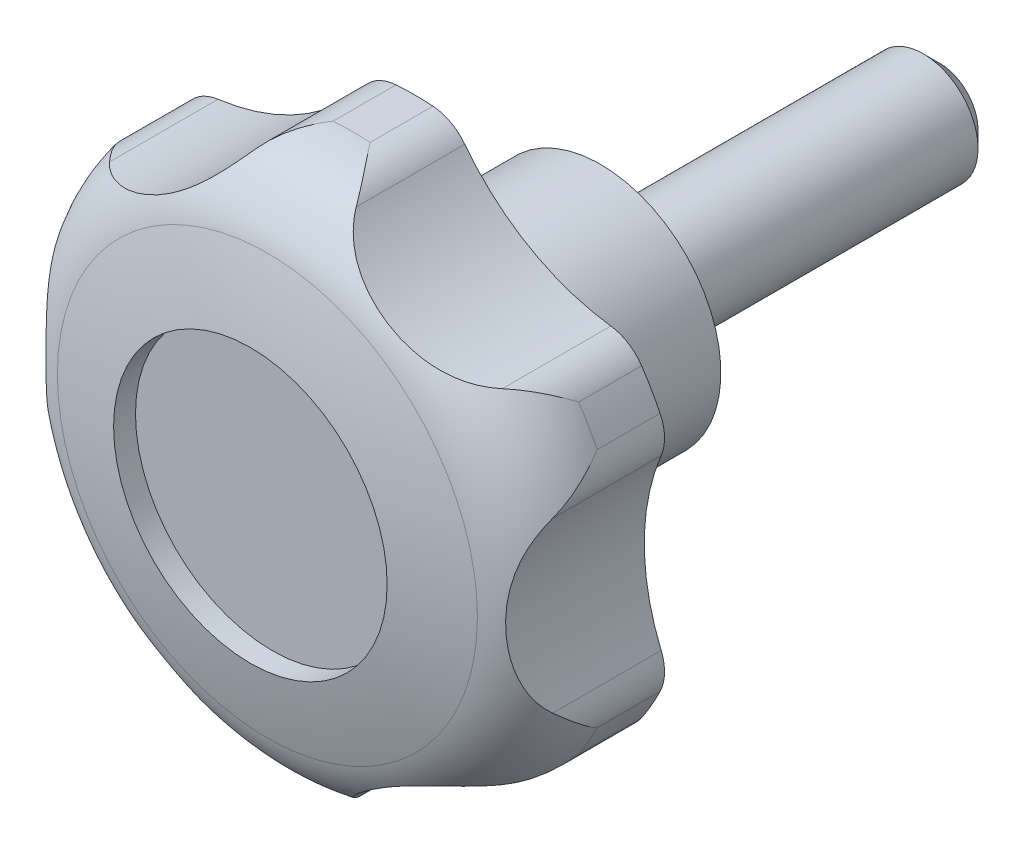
ISO-10303-21;
HEADER;
FILE_DESCRIPTION(('STEP AP214'),'2;1');
FILE_NAME('part.step','',(''),(''),'','','');
FILE_SCHEMA(('AUTOMOTIVE_DESIGN { 1 0 10303 214 1 1 1 1 }'));
ENDSEC;
DATA;
#1=APPLICATION_CONTEXT('core data for automotive mechanical design processes');
#2=APPLICATION_PROTOCOL_DEFINITION('international standard','automotive_design',2000,#1);
#3=PRODUCT_CONTEXT('',#1,'mechanical');
#4=PRODUCT('Part','Part','',(#3));
#5=PRODUCT_RELATED_PRODUCT_CATEGORY('part','',(#4));
#6=PRODUCT_DEFINITION_FORMATION('','',#4);
#7=PRODUCT_DEFINITION_CONTEXT('part definition',#1,'design');
#8=PRODUCT_DEFINITION('design','',#6,#7);
#9=PRODUCT_DEFINITION_SHAPE('','',#8);
#10=(LENGTH_UNIT() NAMED_UNIT(*) SI_UNIT(.MILLI.,.METRE.));
#11=(NAMED_UNIT(*) PLANE_ANGLE_UNIT() SI_UNIT($,.RADIAN.));
#12=(NAMED_UNIT(*) SI_UNIT($,.STERADIAN.) SOLID_ANGLE_UNIT());
#13=UNCERTAINTY_MEASURE_WITH_UNIT(LENGTH_MEASURE(1.E-05),#10,'distance_accuracy_value','');
#14=(GEOMETRIC_REPRESENTATION_CONTEXT(3) GLOBAL_UNCERTAINTY_ASSIGNED_CONTEXT((#13)) GLOBAL_UNIT_ASSIGNED_CONTEXT((#10,
#11,#12)) REPRESENTATION_CONTEXT('',''));
#15=CARTESIAN_POINT('',(0.,0.,0.));
#16=DIRECTION('',(0.,0.,1.));
#17=DIRECTION('',(1.,0.,0.));
#18=AXIS2_PLACEMENT_3D('',#15,#16,#17);
#19=CARTESIAN_POINT('',(0.,3.62930142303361,0.));
#20=DIRECTION('',(0.,0.,1.));
#21=DIRECTION('',(-1.,0.,0.));
#22=AXIS2_PLACEMENT_3D('',#19,#20,#21);
#23=PLANE('',#22);
#24=CARTESIAN_POINT('',(0.,0.,0.));
#25=DIRECTION('',(0.,0.,1.));
#26=DIRECTION('',(1.,0.,0.));
#27=AXIS2_PLACEMENT_3D('',#24,#25,#26);
#28=CIRCLE('',#27,4.65);
#29=CARTESIAN_POINT('',(4.65,0.,0.));
#30=VERTEX_POINT('',#29);
#31=EDGE_CURVE('E22',#30,#30,#28,.T.);
#32=ORIENTED_EDGE('',*,*,#31,.T.);
#33=EDGE_LOOP('',(#32));
#34=FACE_BOUND('',#33,.T.);
#35=CARTESIAN_POINT('',(0.,0.,0.));
#36=DIRECTION('',(0.,0.,1.));
#37=DIRECTION('',(-1.,0.,0.));
#38=AXIS2_PLACEMENT_3D('',#35,#36,#37);
#39=CIRCLE('',#38,7.);
#40=CARTESIAN_POINT('',(-7.,0.,0.));
#41=VERTEX_POINT('',#40);
#42=EDGE_CURVE('E462',#41,#41,#39,.T.);
#43=ORIENTED_EDGE('',*,*,#42,.F.);
#44=EDGE_LOOP('',(#43));
#45=FACE_BOUND('',#44,.T.);
#46=ADVANCED_FACE('F14',(#34,#45),#23,.F.);
#47=CARTESIAN_POINT('',(0.,0.,42.6076490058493));
#48=DIRECTION('',(0.,0.,1.));
#49=DIRECTION('',(-1.,0.,0.));
#50=AXIS2_PLACEMENT_3D('',#47,#48,#49);
#51=CYLINDRICAL_SURFACE('',#50,25.);
#52=CARTESIAN_POINT('',(0.,0.,18.));
#53=DIRECTION('',(0.,0.,1.));
#54=DIRECTION('',(-1.,0.,0.));
#55=AXIS2_PLACEMENT_3D('',#52,#53,#54);
#56=CIRCLE('',#55,25.);
#57=CARTESIAN_POINT('',(22.4448315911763,11.0104284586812,18.));
#58=VERTEX_POINT('',#57);
#59=CARTESIAN_POINT('',(20.7577265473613,13.9325801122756,18.));
#60=VERTEX_POINT('',#59);
#61=EDGE_CURVE('E444',#58,#60,#56,.T.);
#62=ORIENTED_EDGE('',*,*,#61,.T.);
#63=DIRECTION('',(0.,0.,1.));
#64=VECTOR('',#63,1.);
#65=CARTESIAN_POINT('',(20.7577265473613,13.9325801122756,-29.));
#66=LINE('',#65,#64);
#67=CARTESIAN_POINT('',(20.7577265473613,13.9325801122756,23.748934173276));
#68=VERTEX_POINT('',#67);
#69=EDGE_CURVE('E182',#60,#68,#66,.T.);
#70=ORIENTED_EDGE('',*,*,#69,.T.);
#71=CARTESIAN_POINT('',(0.,0.,23.748934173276));
#72=DIRECTION('',(0.,0.,1.));
#73=DIRECTION('',(-1.,0.,0.));
#74=AXIS2_PLACEMENT_3D('',#71,#72,#73);
#75=CIRCLE('',#74,25.);
#76=CARTESIAN_POINT('',(22.4448315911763,11.0104284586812,23.748934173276));
#77=VERTEX_POINT('',#76);
#78=EDGE_CURVE('E198',#77,#68,#75,.T.);
#79=ORIENTED_EDGE('',*,*,#78,.F.);
#80=DIRECTION('',(0.,0.,1.));
#81=VECTOR('',#80,1.);
#82=CARTESIAN_POINT('',(22.4448315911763,11.0104284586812,-29.));
#83=LINE('',#82,#81);
#84=EDGE_CURVE('E851',#58,#77,#83,.T.);
#85=ORIENTED_EDGE('',*,*,#84,.F.);
#86=EDGE_LOOP('',(#62,#70,#79,#85));
#87=FACE_BOUND('',#86,.T.);
#88=ADVANCED_FACE('F403',(#87),#51,.T.);
#89=CARTESIAN_POINT('',(20.7577265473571,-13.9325801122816,18.));
#90=VERTEX_POINT('',#89);
#91=CARTESIAN_POINT('',(22.444831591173,-11.0104284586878,18.));
#92=VERTEX_POINT('',#91);
#93=EDGE_CURVE('E445',#90,#92,#56,.T.);
#94=ORIENTED_EDGE('',*,*,#93,.T.);
#95=DIRECTION('',(0.,0.,1.));
#96=VECTOR('',#95,1.);
#97=CARTESIAN_POINT('',(22.444831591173,-11.0104284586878,-29.));
#98=LINE('',#97,#96);
#99=CARTESIAN_POINT('',(22.444831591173,-11.0104284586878,23.748934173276));
#100=VERTEX_POINT('',#99);
#101=EDGE_CURVE('E843',#92,#100,#98,.T.);
#102=ORIENTED_EDGE('',*,*,#101,.T.);
#103=CARTESIAN_POINT('',(20.7577265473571,-13.9325801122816,23.748934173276));
#104=VERTEX_POINT('',#103);
#105=EDGE_CURVE('E887',#104,#100,#75,.T.);
#106=ORIENTED_EDGE('',*,*,#105,.F.);
#107=DIRECTION('',(0.,0.,1.));
#108=VECTOR('',#107,1.);
#109=CARTESIAN_POINT('',(20.7577265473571,-13.9325801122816,-29.));
#110=LINE('',#109,#108);
#111=EDGE_CURVE('E841',#90,#104,#110,.T.);
#112=ORIENTED_EDGE('',*,*,#111,.F.);
#113=EDGE_LOOP('',(#94,#102,#106,#112));
#114=FACE_BOUND('',#113,.T.);
#115=ADVANCED_FACE('F405',(#114),#51,.T.);
#116=CARTESIAN_POINT('',(-1.68710504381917,-24.9430085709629,18.));
#117=VERTEX_POINT('',#116);
#118=CARTESIAN_POINT('',(1.68710504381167,-24.9430085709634,18.));
#119=VERTEX_POINT('',#118);
#120=EDGE_CURVE('E451',#117,#119,#56,.T.);
#121=ORIENTED_EDGE('',*,*,#120,.T.);
#122=DIRECTION('',(0.,0.,1.));
#123=VECTOR('',#122,1.);
#124=CARTESIAN_POINT('',(1.68710504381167,-24.9430085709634,-29.));
#125=LINE('',#124,#123);
#126=CARTESIAN_POINT('',(1.68710504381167,-24.9430085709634,23.748934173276));
#127=VERTEX_POINT('',#126);
#128=EDGE_CURVE('E832',#119,#127,#125,.T.);
#129=ORIENTED_EDGE('',*,*,#128,.T.);
#130=CARTESIAN_POINT('',(-1.68710504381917,-24.9430085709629,23.748934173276));
#131=VERTEX_POINT('',#130);
#132=EDGE_CURVE('E456',#131,#127,#75,.T.);
#133=ORIENTED_EDGE('',*,*,#132,.F.);
#134=DIRECTION('',(0.,0.,1.));
#135=VECTOR('',#134,1.);
#136=CARTESIAN_POINT('',(-1.68710504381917,-24.9430085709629,-29.));
#137=LINE('',#136,#135);
#138=EDGE_CURVE('E826',#117,#131,#137,.T.);
#139=ORIENTED_EDGE('',*,*,#138,.F.);
#140=EDGE_LOOP('',(#121,#129,#133,#139));
#141=FACE_BOUND('',#140,.T.);
#142=ADVANCED_FACE('F414',(#141),#51,.T.);
#143=CARTESIAN_POINT('',(-22.4448315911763,-11.010428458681,18.));
#144=VERTEX_POINT('',#143);
#145=CARTESIAN_POINT('',(-20.7577265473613,-13.9325801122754,18.));
#146=VERTEX_POINT('',#145);
#147=EDGE_CURVE('E447',#144,#146,#56,.T.);
#148=ORIENTED_EDGE('',*,*,#147,.T.);
#149=DIRECTION('',(0.,0.,1.));
#150=VECTOR('',#149,1.);
#151=CARTESIAN_POINT('',(-20.7577265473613,-13.9325801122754,-29.));
#152=LINE('',#151,#150);
#153=CARTESIAN_POINT('',(-20.7577265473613,-13.9325801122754,23.748934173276));
#154=VERTEX_POINT('',#153);
#155=EDGE_CURVE('E813',#146,#154,#152,.T.);
#156=ORIENTED_EDGE('',*,*,#155,.T.);
#157=CARTESIAN_POINT('',(-22.4448315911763,-11.010428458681,23.748934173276));
#158=VERTEX_POINT('',#157);
#159=EDGE_CURVE('E452',#158,#154,#75,.T.);
#160=ORIENTED_EDGE('',*,*,#159,.F.);
#161=DIRECTION('',(0.,0.,1.));
#162=VECTOR('',#161,1.);
#163=CARTESIAN_POINT('',(-22.4448315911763,-11.010428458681,-29.));
#164=LINE('',#163,#162);
#165=EDGE_CURVE('E814',#144,#158,#164,.T.);
#166=ORIENTED_EDGE('',*,*,#165,.F.);
#167=EDGE_LOOP('',(#148,#156,#160,#166));
#168=FACE_BOUND('',#167,.T.);
#169=ADVANCED_FACE('F431',(#168),#51,.T.);
#170=CARTESIAN_POINT('',(-20.7577265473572,13.9325801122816,18.));
#171=VERTEX_POINT('',#170);
#172=CARTESIAN_POINT('',(-22.444831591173,11.0104284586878,18.));
#173=VERTEX_POINT('',#172);
#174=EDGE_CURVE('E203',#171,#173,#56,.T.);
#175=ORIENTED_EDGE('',*,*,#174,.T.);
#176=DIRECTION('',(0.,0.,1.));
#177=VECTOR('',#176,1.);
#178=CARTESIAN_POINT('',(-22.444831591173,11.0104284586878,-29.));
#179=LINE('',#178,#177);
#180=CARTESIAN_POINT('',(-22.444831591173,11.0104284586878,23.748934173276));
#181=VERTEX_POINT('',#180);
#182=EDGE_CURVE('E37',#173,#181,#179,.T.);
#183=ORIENTED_EDGE('',*,*,#182,.T.);
#184=CARTESIAN_POINT('',(-20.7577265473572,13.9325801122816,23.748934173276));
#185=VERTEX_POINT('',#184);
#186=EDGE_CURVE('E450',#185,#181,#75,.T.);
#187=ORIENTED_EDGE('',*,*,#186,.F.);
#188=DIRECTION('',(0.,0.,1.));
#189=VECTOR('',#188,1.);
#190=CARTESIAN_POINT('',(-20.7577265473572,13.9325801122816,-29.));
#191=LINE('',#190,#189);
#192=EDGE_CURVE('E864',#171,#185,#191,.T.);
#193=ORIENTED_EDGE('',*,*,#192,.F.);
#194=EDGE_LOOP('',(#175,#183,#187,#193));
#195=FACE_BOUND('',#194,.T.);
#196=ADVANCED_FACE('F421',(#195),#51,.T.);
#197=CARTESIAN_POINT('',(1.68710504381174,24.9430085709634,18.));
#198=VERTEX_POINT('',#197);
#199=CARTESIAN_POINT('',(-1.6871050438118,24.9430085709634,18.));
#200=VERTEX_POINT('',#199);
#201=EDGE_CURVE('E437',#198,#200,#56,.T.);
#202=ORIENTED_EDGE('',*,*,#201,.T.);
#203=DIRECTION('',(0.,0.,1.));
#204=VECTOR('',#203,1.);
#205=CARTESIAN_POINT('',(-1.6871050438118,24.9430085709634,-29.));
#206=LINE('',#205,#204);
#207=CARTESIAN_POINT('',(-1.6871050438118,24.9430085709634,23.748934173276));
#208=VERTEX_POINT('',#207);
#209=EDGE_CURVE('E439',#200,#208,#206,.T.);
#210=ORIENTED_EDGE('',*,*,#209,.T.);
#211=CARTESIAN_POINT('',(1.68710504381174,24.9430085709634,23.748934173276));
#212=VERTEX_POINT('',#211);
#213=EDGE_CURVE('E886',#212,#208,#75,.T.);
#214=ORIENTED_EDGE('',*,*,#213,.F.);
#215=DIRECTION('',(0.,0.,1.));
#216=VECTOR('',#215,1.);
#217=CARTESIAN_POINT('',(1.68710504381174,24.9430085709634,-29.));
#218=LINE('',#217,#216);
#219=EDGE_CURVE('E441',#198,#212,#218,.T.);
#220=ORIENTED_EDGE('',*,*,#219,.F.);
#221=EDGE_LOOP('',(#202,#210,#214,#220));
#222=FACE_BOUND('',#221,.T.);
#223=ADVANCED_FACE('F407',(#222),#51,.T.);
#224=CARTESIAN_POINT('',(0.,0.,42.6076490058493));
#225=DIRECTION('',(0.,0.,1.));
#226=DIRECTION('',(-1.,0.,0.));
#227=AXIS2_PLACEMENT_3D('',#224,#225,#226);
#228=CYLINDRICAL_SURFACE('',#227,11.);
#229=CARTESIAN_POINT('',(0.,0.,1.));
#230=DIRECTION('',(0.,0.,1.));
#231=DIRECTION('',(-1.,0.,0.));
#232=AXIS2_PLACEMENT_3D('',#229,#230,#231);
#233=CIRCLE('',#232,11.);
#234=CARTESIAN_POINT('',(-11.,0.,1.));
#235=VERTEX_POINT('',#234);
#236=EDGE_CURVE('E468',#235,#235,#233,.T.);
#237=ORIENTED_EDGE('',*,*,#236,.T.);
#238=EDGE_LOOP('',(#237));
#239=FACE_BOUND('',#238,.T.);
#240=CARTESIAN_POINT('',(0.,0.,18.));
#241=DIRECTION('',(0.,0.,1.));
#242=DIRECTION('',(-1.,0.,0.));
#243=AXIS2_PLACEMENT_3D('',#240,#241,#242);
#244=CIRCLE('',#243,11.);
#245=CARTESIAN_POINT('',(-11.,0.,18.));
#246=VERTEX_POINT('',#245);
#247=EDGE_CURVE('E199',#246,#246,#244,.T.);
#248=ORIENTED_EDGE('',*,*,#247,.F.);
#249=EDGE_LOOP('',(#248));
#250=FACE_BOUND('',#249,.T.);
#251=ADVANCED_FACE('F420',(#239,#250),#228,.T.);
#252=CARTESIAN_POINT('',(0.,11.,1.));
#253=DIRECTION('',(0.,0.,-1.));
#254=DIRECTION('',(1.,0.,0.));
#255=AXIS2_PLACEMENT_3D('',#252,#253,#254);
#256=PLANE('',#255);
#257=CARTESIAN_POINT('',(0.,0.,1.));
#258=DIRECTION('',(0.,0.,1.));
#259=DIRECTION('',(-1.,0.,0.));
#260=AXIS2_PLACEMENT_3D('',#257,#258,#259);
#261=CIRCLE('',#260,7.);
#262=CARTESIAN_POINT('',(-7.,0.,1.));
#263=VERTEX_POINT('',#262);
#264=EDGE_CURVE('E465',#263,#263,#261,.T.);
#265=ORIENTED_EDGE('',*,*,#264,.T.);
#266=EDGE_LOOP('',(#265));
#267=FACE_BOUND('',#266,.T.);
#268=ORIENTED_EDGE('',*,*,#236,.F.);
#269=EDGE_LOOP('',(#268));
#270=FACE_BOUND('',#269,.T.);
#271=ADVANCED_FACE('F428',(#267,#270),#256,.T.);
#272=CARTESIAN_POINT('',(0.,0.,42.6076490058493));
#273=DIRECTION('',(0.,0.,1.));
#274=DIRECTION('',(-1.,0.,0.));
#275=AXIS2_PLACEMENT_3D('',#272,#273,#274);
#276=CYLINDRICAL_SURFACE('',#275,7.);
#277=ORIENTED_EDGE('',*,*,#42,.T.);
#278=EDGE_LOOP('',(#277));
#279=FACE_BOUND('',#278,.T.);
#280=ORIENTED_EDGE('',*,*,#264,.F.);
#281=EDGE_LOOP('',(#280));
#282=FACE_BOUND('',#281,.T.);
#283=ADVANCED_FACE('F564',(#279,#282),#276,.T.);
#284=CARTESIAN_POINT('',(0.,-3.88578058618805E-13,-35.8748865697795));
#285=DIRECTION('',(-1.,0.,0.));
#286=DIRECTION('',(0.,0.,-1.));
#287=AXIS2_PLACEMENT_3D('',#284,#285,#286);
#288=SPHERICAL_SURFACE('',#287,70.);
#289=CARTESIAN_POINT('',(0.,-3.88578058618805E-13,-35.8748865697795));
#290=DIRECTION('',(0.,0.,1.));
#291=DIRECTION('',(-1.,0.,0.));
#292=AXIS2_PLACEMENT_3D('',#289,#290,#291);
#293=SPHERICAL_SURFACE('',#292,70.);
#294=CARTESIAN_POINT('',(0.,0.,31.4423303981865));
#295=DIRECTION('',(0.,0.,1.));
#296=DIRECTION('',(-1.,0.,0.));
#297=AXIS2_PLACEMENT_3D('',#294,#295,#296);
#298=CIRCLE('',#297,19.1935483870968);
#299=CARTESIAN_POINT('',(-19.1935483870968,0.,31.4423303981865));
#300=VERTEX_POINT('',#299);
#301=EDGE_CURVE('E455',#300,#300,#298,.T.);
#302=ORIENTED_EDGE('',*,*,#301,.T.);
#303=EDGE_LOOP('',(#302));
#304=FACE_BOUND('',#303,.T.);
#305=CARTESIAN_POINT('',(0.,0.,33.));
#306=DIRECTION('',(0.,0.,-1.));
#307=DIRECTION('',(1.,0.,0.));
#308=AXIS2_PLACEMENT_3D('',#305,#306,#307);
#309=CIRCLE('',#308,12.5);
#310=CARTESIAN_POINT('',(12.5,0.,33.));
#311=VERTEX_POINT('',#310);
#312=EDGE_CURVE('E911',#311,#311,#309,.T.);
#313=ORIENTED_EDGE('',*,*,#312,.T.);
#314=EDGE_LOOP('',(#313));
#315=FACE_BOUND('',#314,.T.);
#316=ADVANCED_FACE('F562',(#304,#315),#293,.T.);
#317=CARTESIAN_POINT('',(0.,0.,23.748934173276));
#318=DIRECTION('',(0.,0.,1.));
#319=DIRECTION('',(-1.,0.,0.));
#320=AXIS2_PLACEMENT_3D('',#317,#318,#319);
#321=TOROIDAL_SURFACE('',#320,17.,8.);
#322=CARTESIAN_POINT('',(22.444831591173,11.0104284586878,23.748934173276));
#323=CARTESIAN_POINT('',(22.4464357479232,11.0071583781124,23.7536552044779));
#324=CARTESIAN_POINT('',(22.4480354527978,11.003886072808,23.758376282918));
#325=CARTESIAN_POINT('',(22.5292989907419,10.8370787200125,23.9988749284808));
#326=CARTESIAN_POINT('',(22.597851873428,10.6680207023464,24.2347597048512));
#327=CARTESIAN_POINT('',(22.7115523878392,10.3211392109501,24.705775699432));
#328=CARTESIAN_POINT('',(22.7566913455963,10.143312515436,24.9409066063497));
#329=CARTESIAN_POINT('',(22.8223990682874,9.78080623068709,25.4099624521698));
#330=CARTESIAN_POINT('',(22.8429294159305,9.59611638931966,25.6438849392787));
#331=CARTESIAN_POINT('',(22.8579355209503,9.22263939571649,26.1090481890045));
#332=CARTESIAN_POINT('',(22.8524280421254,9.03385495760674,26.3402905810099));
#333=CARTESIAN_POINT('',(22.8138212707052,8.65409842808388,26.7998440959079));
#334=CARTESIAN_POINT('',(22.7806472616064,8.46312179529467,27.0281455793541));
#335=CARTESIAN_POINT('',(22.7089141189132,8.17797071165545,27.3665346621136));
#336=CARTESIAN_POINT('',(22.6813764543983,8.08322589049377,27.4785526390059));
#337=CARTESIAN_POINT('',(22.6187377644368,7.89448609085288,27.7011813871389));
#338=CARTESIAN_POINT('',(22.5836333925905,7.80049146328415,27.8117915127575));
#339=CARTESIAN_POINT('',(22.5446319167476,7.7070999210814,27.9215846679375));
#340=B_SPLINE_CURVE_WITH_KNOTS('',3,(#322,#323,#324,#325,#326,#327,#328,#329,#330,#331,#332,
#333,#334,#335,#336,#337,#338,#339),.UNSPECIFIED.,.F.,.F.,(4,2,2,2,2,2,2,2,4),(0.,
0.0178885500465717,0.911260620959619,1.80496341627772,2.70005959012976,3.59457955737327,
4.49152312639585,4.93917199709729,5.38701924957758),.UNSPECIFIED.);
#341=CARTESIAN_POINT('',(22.5447154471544,7.70729992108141,27.921349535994));
#342=VERTEX_POINT('',#341);
#343=EDGE_CURVE('E200',#77,#342,#340,.T.);
#344=ORIENTED_EDGE('',*,*,#343,.F.);
#345=ORIENTED_EDGE('',*,*,#78,.T.);
#346=CARTESIAN_POINT('',(17.9468752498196,15.6706720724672,27.921568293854));
#347=CARTESIAN_POINT('',(18.1177987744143,15.6486439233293,27.7346266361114));
#348=CARTESIAN_POINT('',(18.2845665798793,15.6160053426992,27.5453205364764));
#349=CARTESIAN_POINT('',(18.6084954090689,15.5314831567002,27.1630391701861));
#350=CARTESIAN_POINT('',(18.765663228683,15.479613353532,26.9700666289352));
#351=CARTESIAN_POINT('',(19.0689959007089,15.3587065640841,26.5816885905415));
#352=CARTESIAN_POINT('',(19.2151852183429,15.2897093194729,26.3862897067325));
#353=CARTESIAN_POINT('',(19.4960047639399,15.136152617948,25.9933429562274));
#354=CARTESIAN_POINT('',(19.630634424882,15.0515923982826,25.7957949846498));
#355=CARTESIAN_POINT('',(19.9555959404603,14.8198368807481,25.2939411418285));
#356=CARTESIAN_POINT('',(20.1376177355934,14.663202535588,24.9885622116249));
#357=CARTESIAN_POINT('',(20.4694412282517,14.3220932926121,24.3764105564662));
#358=CARTESIAN_POINT('',(20.6192843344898,14.1376547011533,24.0696401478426));
#359=CARTESIAN_POINT('',(20.7536626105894,13.9386259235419,23.7583762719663));
#360=CARTESIAN_POINT('',(20.7556966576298,13.9356043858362,23.7536551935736));
#361=CARTESIAN_POINT('',(20.7577265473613,13.9325801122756,23.748934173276));
#362=B_SPLINE_CURVE_WITH_KNOTS('',3,(#346,#347,#348,#349,#350,#351,#352,#353,#354,#355,#356,
#357,#358,#359,#360,#361),.UNSPECIFIED.,.F.,.F.,(4,2,2,2,2,2,2,4),(0.,0.76231171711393,
1.52407738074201,2.28409173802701,3.04414335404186,4.20715114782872,5.36865325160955,
5.38654180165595),.UNSPECIFIED.);
#363=CARTESIAN_POINT('',(17.9470752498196,15.6706463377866,27.9213495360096));
#364=VERTEX_POINT('',#363);
#365=EDGE_CURVE('E186',#364,#68,#362,.T.);
#366=ORIENTED_EDGE('',*,*,#365,.F.);
#367=CARTESIAN_POINT('',(17.9472752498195,15.6706205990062,27.921130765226));
#368=CARTESIAN_POINT('',(17.8000960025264,15.6895370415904,28.0822346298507));
#369=CARTESIAN_POINT('',(17.6451448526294,15.7111642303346,28.2357655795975));
#370=CARTESIAN_POINT('',(17.3223674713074,15.7604215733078,28.5271060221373));
#371=CARTESIAN_POINT('',(17.1545598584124,15.7880431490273,28.6649375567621));
#372=CARTESIAN_POINT('',(16.8102495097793,15.8495736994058,28.9233052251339));
#373=CARTESIAN_POINT('',(16.633865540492,15.8834086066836,29.0440181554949));
#374=CARTESIAN_POINT('',(16.2729388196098,15.9579775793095,29.2702246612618));
#375=CARTESIAN_POINT('',(16.0883935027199,15.9987138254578,29.3757134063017));
#376=CARTESIAN_POINT('',(15.7143264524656,16.0871013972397,29.5714668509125));
#377=CARTESIAN_POINT('',(15.5248361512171,16.1347150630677,29.6618090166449));
#378=CARTESIAN_POINT('',(15.1418469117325,16.2371300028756,29.8287610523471));
#379=CARTESIAN_POINT('',(14.9483483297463,16.2919306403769,29.905372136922));
#380=CARTESIAN_POINT('',(14.5583551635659,16.4089153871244,30.0460657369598));
#381=CARTESIAN_POINT('',(14.3618533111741,16.4711212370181,30.1101098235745));
#382=CARTESIAN_POINT('',(13.9677629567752,16.6027276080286,30.226437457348));
#383=CARTESIAN_POINT('',(13.7701742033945,16.6721298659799,30.278718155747));
#384=CARTESIAN_POINT('',(13.2568720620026,16.8616609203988,30.4006076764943));
#385=CARTESIAN_POINT('',(12.9411866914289,16.987303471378,30.4618798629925));
#386=CARTESIAN_POINT('',(12.3135074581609,17.256066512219,30.5606509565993));
#387=CARTESIAN_POINT('',(12.0015155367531,17.3991957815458,30.5981378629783));
#388=CARTESIAN_POINT('',(11.3830678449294,17.7025343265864,30.6519278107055));
#389=CARTESIAN_POINT('',(11.0766289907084,17.8627879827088,30.6681742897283));
#390=CARTESIAN_POINT('',(10.4722361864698,18.199137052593,30.68048788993));
#391=CARTESIAN_POINT('',(10.1742808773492,18.375229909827,30.6765582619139));
#392=CARTESIAN_POINT('',(9.58255501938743,18.7459626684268,30.6479465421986));
#393=CARTESIAN_POINT('',(9.28899683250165,18.9409097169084,30.6228389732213));
#394=CARTESIAN_POINT('',(8.71439077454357,19.3446564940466,30.5494207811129));
#395=CARTESIAN_POINT('',(8.43334617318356,19.5534598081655,30.501104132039));
#396=CARTESIAN_POINT('',(7.88706048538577,19.9817784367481,30.3782042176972));
#397=CARTESIAN_POINT('',(7.62176755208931,20.2012537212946,30.3037134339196));
#398=CARTESIAN_POINT('',(7.10876905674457,20.6480271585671,30.1242106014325));
#399=CARTESIAN_POINT('',(6.86104855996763,20.8753184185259,30.0192248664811));
#400=CARTESIAN_POINT('',(6.48058176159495,21.2418536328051,29.8228937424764));
#401=CARTESIAN_POINT('',(6.34121880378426,21.3802460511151,29.7426671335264));
#402=CARTESIAN_POINT('',(6.07081213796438,21.6565601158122,29.5685988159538));
#403=CARTESIAN_POINT('',(5.93976564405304,21.794481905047,29.4747617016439));
#404=CARTESIAN_POINT('',(5.68708094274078,22.0678451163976,29.2729986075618));
#405=CARTESIAN_POINT('',(5.56542019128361,22.2032918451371,29.1651081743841));
#406=CARTESIAN_POINT('',(5.3319744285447,22.4700784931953,28.9346793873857));
#407=CARTESIAN_POINT('',(5.22018481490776,22.601420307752,28.8121479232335));
#408=CARTESIAN_POINT('',(5.01910520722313,22.8435588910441,28.5669102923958));
#409=CARTESIAN_POINT('',(4.92869795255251,22.9550077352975,28.4457651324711));
#410=CARTESIAN_POINT('',(4.75649074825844,23.1716770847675,28.1919642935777));
#411=CARTESIAN_POINT('',(4.67470230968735,23.2768891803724,28.0592936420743));
#412=CARTESIAN_POINT('',(4.59748765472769,23.378146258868,27.92107664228));
#413=B_SPLINE_CURVE_WITH_KNOTS('',3,(#367,#368,#369,#370,#371,#372,#373,#374,#375,#376,#377,
#378,#379,#380,#381,#382,#383,#384,#385,#386,#387,#388,#389,#390,#391,#392,#393,#394,#395,#396,
#397,#398,#399,#400,#401,#402,#403,#404,#405,#406,#407,#408,#409,#410,#411,#412),.UNSPECIFIED.,
.F.,.F.,(4,2,2,2,2,2,2,2,2,2,2,2,2,2,2,2,2,2,2,2,2,2,4),(0.,0.656644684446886,1.31235577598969,
1.96070546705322,2.60926041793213,3.25438989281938,3.89946227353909,4.54647750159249,
5.19364925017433,6.22787361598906,7.26261937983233,8.300115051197,9.33744356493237,
10.3961231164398,11.4550776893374,12.5103276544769,13.5646697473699,14.2006301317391,
14.8363763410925,15.4705446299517,16.1044156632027,16.6671921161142,17.2307109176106),.UNSPECIFIED.);
#414=CARTESIAN_POINT('',(4.59764019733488,23.377946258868,27.921349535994));
#415=VERTEX_POINT('',#414);
#416=EDGE_CURVE('E174',#364,#415,#413,.T.);
#417=ORIENTED_EDGE('',*,*,#416,.T.);
#418=CARTESIAN_POINT('',(1.68710504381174,24.9430085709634,23.748934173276));
#419=CARTESIAN_POINT('',(1.69073909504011,24.9427627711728,23.7536552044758));
#420=CARTESIAN_POINT('',(1.69437284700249,24.9425120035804,23.7583762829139));
#421=CARTESIAN_POINT('',(1.8794640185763,24.9294846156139,23.9988749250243));
#422=CARTESIAN_POINT('',(2.06014899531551,24.9043241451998,24.2347596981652));
#423=CARTESIAN_POINT('',(2.417407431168,24.8293509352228,24.7057756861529));
#424=CARTESIAN_POINT('',(2.59397934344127,24.7795290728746,24.9409065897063));
#425=CARTESIAN_POINT('',(2.94077285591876,24.6551804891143,25.409962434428));
#426=CARTESIAN_POINT('',(3.11098412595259,24.5806153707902,25.6438849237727));
#427=CARTESIAN_POINT('',(3.44192774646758,24.4068725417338,26.1090481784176));
#428=CARTESIAN_POINT('',(3.60266612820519,24.3077107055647,26.3402905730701));
#429=CARTESIAN_POINT('',(3.91224597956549,24.0843947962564,26.7998506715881));
#430=CARTESIAN_POINT('',(4.06105367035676,23.9601730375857,27.0281586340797));
#431=CARTESIAN_POINT('',(4.27214053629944,23.7554678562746,27.3665571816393));
#432=CARTESIAN_POINT('',(4.34042478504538,23.6842446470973,27.4785782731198));
#433=CARTESIAN_POINT('',(4.47256192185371,23.5356227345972,27.7012131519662));
#434=CARTESIAN_POINT('',(4.5364128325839,23.4582213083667,27.8118262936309));
#435=CARTESIAN_POINT('',(4.59779273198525,23.377746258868,27.9216224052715));
#436=B_SPLINE_CURVE_WITH_KNOTS('',3,(#418,#419,#420,#421,#422,#423,#424,#425,#426,#427,#428,
#429,#430,#431,#432,#433,#434,#435),.UNSPECIFIED.,.F.,.F.,(4,2,2,2,2,2,2,2,4),(0.,
0.0178885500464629,0.911260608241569,1.80496339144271,2.70005957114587,3.59457955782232,
4.49154874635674,4.93921044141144,5.38707053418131),.UNSPECIFIED.);
#437=EDGE_CURVE('E181',#212,#415,#436,.T.);
#438=ORIENTED_EDGE('',*,*,#437,.F.);
#439=ORIENTED_EDGE('',*,*,#213,.T.);
#440=CARTESIAN_POINT('',(-4.5977927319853,23.377746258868,27.9216224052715));
#441=CARTESIAN_POINT('',(-4.49325605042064,23.5147571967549,27.7346823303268));
#442=CARTESIAN_POINT('',(-4.38160827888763,23.6428640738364,27.5453777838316));
#443=CARTESIAN_POINT('',(-4.14644934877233,23.8811358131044,27.1630994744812));
#444=CARTESIAN_POINT('',(-4.02294674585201,23.9913134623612,26.9701284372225));
#445=CARTESIAN_POINT('',(-3.76657567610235,24.1935565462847,26.5817533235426));
#446=CARTESIAN_POINT('',(-3.63372939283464,24.2856630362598,26.3863558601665));
#447=CARTESIAN_POINT('',(-3.36033897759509,24.4520846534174,25.9934118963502));
#448=CARTESIAN_POINT('',(-3.21979446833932,24.5263989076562,25.7958652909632));
#449=CARTESIAN_POINT('',(-2.8566015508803,24.6919550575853,25.2940011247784));
#450=CARTESIAN_POINT('',(-2.6299329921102,24.7712789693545,24.9886102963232));
#451=CARTESIAN_POINT('',(-2.16859445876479,24.8880997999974,24.3764346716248));
#452=CARTESIAN_POINT('',(-1.93393522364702,24.92565073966,24.0696521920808));
#453=CARTESIAN_POINT('',(-1.69437283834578,24.9425120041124,23.7583762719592));
#454=CARTESIAN_POINT('',(-1.69073908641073,24.9427627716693,23.7536551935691));
#455=CARTESIAN_POINT('',(-1.68710504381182,24.9430085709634,23.748934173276));
#456=B_SPLINE_CURVE_WITH_KNOTS('',3,(#440,#441,#442,#443,#444,#445,#446,#447,#448,#449,#450,
#451,#452,#453,#454,#455),.UNSPECIFIED.,.F.,.F.,(4,2,2,2,2,2,2,4),(0.,0.762307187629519,
1.52406829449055,2.28407821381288,3.04412541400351,4.20717896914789,5.3687267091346,
5.38661525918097),.UNSPECIFIED.);
#457=CARTESIAN_POINT('',(-4.59764019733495,23.377946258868,27.9213495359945));
#458=VERTEX_POINT('',#457);
#459=EDGE_CURVE('E249',#458,#208,#456,.T.);
#460=ORIENTED_EDGE('',*,*,#459,.F.);
#461=CARTESIAN_POINT('',(-4.59748765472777,23.378146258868,27.92107664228));
#462=CARTESIAN_POINT('',(-4.68745740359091,23.2601455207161,28.0821810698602));
#463=CARTESIAN_POINT('',(-4.78366062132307,23.1367694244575,28.2357127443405));
#464=CARTESIAN_POINT('',(-4.98770324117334,22.88186838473,28.5270549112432));
#465=CARTESIAN_POINT('',(-5.09552590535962,22.7503552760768,28.6648874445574));
#466=CARTESIAN_POINT('',(-5.32096382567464,22.4829423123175,28.9232573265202));
#467=CARTESIAN_POINT('',(-5.43845555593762,22.3471082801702,29.0439714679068));
#468=CARTESIAN_POINT('',(-5.68349322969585,22.0718238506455,29.2701805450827));
#469=CARTESIAN_POINT('',(-5.81104234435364,21.9323723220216,29.3756706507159));
#470=CARTESIAN_POINT('',(-6.07461744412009,21.652616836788,29.5714269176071));
#471=CARTESIAN_POINT('',(-6.21059510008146,21.5123212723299,29.6617705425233));
#472=CARTESIAN_POINT('',(-6.49077939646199,21.2318521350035,29.8287255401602));
#473=CARTESIAN_POINT('',(-6.63498530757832,21.0916785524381,29.9053381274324));
#474=CARTESIAN_POINT('',(-6.93128941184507,20.8124283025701,30.0460347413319));
#475=CARTESIAN_POINT('',(-7.08341006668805,20.6733562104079,30.1100803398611));
#476=CARTESIAN_POINT('',(-7.39442549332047,20.3978680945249,30.2264109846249));
#477=CARTESIAN_POINT('',(-7.55332189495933,20.2614527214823,30.2786931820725));
#478=CARTESIAN_POINT('',(-7.97410593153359,19.9116865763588,30.4005864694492));
#479=CARTESIAN_POINT('',(-8.24075460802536,19.7011167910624,30.4618609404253));
#480=CARTESIAN_POINT('',(-8.78734257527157,19.2919126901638,30.560636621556));
#481=CARTESIAN_POINT('',(-9.0672884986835,19.0932844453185,30.5981258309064));
#482=CARTESIAN_POINT('',(-9.63920400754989,18.7093620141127,30.6519204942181));
#483=CARTESIAN_POINT('',(-9.93120356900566,18.5241046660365,30.6681693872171));
#484=CARTESIAN_POINT('',(-10.5246796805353,18.1688586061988,30.6804880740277));
#485=CARTESIAN_POINT('',(-10.8261546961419,17.9988674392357,30.6765611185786));
#486=CARTESIAN_POINT('',(-11.4430750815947,17.6717820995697,30.6479552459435));
#487=CARTESIAN_POINT('',(-11.7586802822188,17.5150254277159,30.6228508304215));
#488=CARTESIAN_POINT('',(-12.3956325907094,17.2192723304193,30.5494396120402));
#489=CARTESIAN_POINT('',(-12.7169811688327,17.0802805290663,30.5011267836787));
#490=CARTESIAN_POINT('',(-13.3610540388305,16.8213387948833,30.3782353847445));
#491=CARTESIAN_POINT('',(-13.6837695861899,16.7013239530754,30.3037492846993));
#492=CARTESIAN_POINT('',(-14.3271826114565,16.4804364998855,30.1242568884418));
#493=CARTESIAN_POINT('',(-14.6478815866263,16.3795475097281,30.0192769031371));
#494=CARTESIAN_POINT('',(-15.1555460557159,16.2333162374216,29.822954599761));
#495=CARTESIAN_POINT('',(-15.3450819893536,16.1818181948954,29.7427304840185));
#496=CARTESIAN_POINT('',(-15.7195868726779,16.0857915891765,29.5686670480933));
#497=CARTESIAN_POINT('',(-15.9045573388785,16.0412606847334,29.474832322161));
#498=CARTESIAN_POINT('',(-16.2676463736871,15.9591067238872,29.2730738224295));
#499=CARTESIAN_POINT('',(-16.4457808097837,15.9214667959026,29.1651855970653));
#500=CARTESIAN_POINT('',(-16.7935555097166,15.8526864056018,28.9347609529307));
#501=CARTESIAN_POINT('',(-16.9631997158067,15.8215429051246,28.8122314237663));
#502=CARTESIAN_POINT('',(-17.2734523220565,15.768467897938,28.5669917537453));
#503=CARTESIAN_POINT('',(-17.4151836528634,15.7458950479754,28.4458421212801));
#504=CARTESIAN_POINT('',(-17.6889479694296,15.7050898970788,28.1920309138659));
#505=CARTESIAN_POINT('',(-17.8209679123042,15.6868633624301,28.0593543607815));
#506=CARTESIAN_POINT('',(-17.9472752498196,15.6706205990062,27.921130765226));
#507=B_SPLINE_CURVE_WITH_KNOTS('',3,(#461,#462,#463,#464,#465,#466,#467,#468,#469,#470,#471,
#472,#473,#474,#475,#476,#477,#478,#479,#480,#481,#482,#483,#484,#485,#486,#487,#488,#489,#490,
#491,#492,#493,#494,#495,#496,#497,#498,#499,#500,#501,#502,#503,#504,#505,#506),.UNSPECIFIED.,
.F.,.F.,(4,2,2,2,2,2,2,2,2,2,2,2,2,2,2,2,2,2,2,2,2,2,4),(0.,0.656640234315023,1.31234690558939,
1.96069228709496,2.60924292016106,3.2543681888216,3.89943636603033,4.54644734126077,
5.19361483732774,6.22783106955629,7.2625686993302,8.3000561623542,9.33737647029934,
10.3960491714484,11.4549968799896,12.5102403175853,13.5645759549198,14.2005435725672,
14.836297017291,15.4704724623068,16.1043506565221,16.6671595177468,17.2307109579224),.UNSPECIFIED.);
#508=CARTESIAN_POINT('',(-17.9470752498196,15.6706463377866,27.921349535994));
#509=VERTEX_POINT('',#508);
#510=EDGE_CURVE('E255',#458,#509,#507,.T.);
#511=ORIENTED_EDGE('',*,*,#510,.T.);
#512=CARTESIAN_POINT('',(-20.7577265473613,13.9325801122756,23.748934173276));
#513=CARTESIAN_POINT('',(-20.7556966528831,13.9356043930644,23.7536552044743));
#514=CARTESIAN_POINT('',(-20.7536626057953,13.9386259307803,23.7583762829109));
#515=CARTESIAN_POINT('',(-20.6498349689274,14.0924058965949,23.9988749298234));
#516=CARTESIAN_POINT('',(-20.5377028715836,14.2363034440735,24.2347597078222));
#517=CARTESIAN_POINT('',(-20.2941449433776,14.5082117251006,24.7057757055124));
#518=CARTESIAN_POINT('',(-20.1627119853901,14.6362165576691,24.9409066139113));
#519=CARTESIAN_POINT('',(-19.8816261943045,14.8743742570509,25.4099624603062));
#520=CARTESIAN_POINT('',(-19.7319452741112,14.9844989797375,25.643884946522));
#521=CARTESIAN_POINT('',(-19.416007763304,15.1842331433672,26.1090481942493));
#522=CARTESIAN_POINT('',(-19.249761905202,15.2738557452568,26.3402905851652));
#523=CARTESIAN_POINT('',(-18.901581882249,15.4302985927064,26.7998412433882));
#524=CARTESIAN_POINT('',(-18.7196066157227,15.4970566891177,27.0281399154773));
#525=CARTESIAN_POINT('',(-18.4367957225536,15.5775089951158,27.3665248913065));
#526=CARTESIAN_POINT('',(-18.3409767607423,15.6010330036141,27.4785415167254));
#527=CARTESIAN_POINT('',(-18.1462066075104,15.641156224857,27.7011676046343));
#528=CARTESIAN_POINT('',(-18.0472540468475,15.6577523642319,27.8117764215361));
#529=CARTESIAN_POINT('',(-17.9468752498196,15.6706720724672,27.9215682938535));
#530=B_SPLINE_CURVE_WITH_KNOTS('',3,(#512,#513,#514,#515,#516,#517,#518,#519,#520,#521,#522,
#523,#524,#525,#526,#527,#528,#529),.UNSPECIFIED.,.F.,.F.,(4,2,2,2,2,2,2,2,4),(0.,
0.0178885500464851,0.911260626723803,1.80496342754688,2.70005959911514,3.59457955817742,
4.49151201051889,4.93915531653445,5.38699699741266),.UNSPECIFIED.);
#531=EDGE_CURVE('E278',#185,#509,#530,.T.);
#532=ORIENTED_EDGE('',*,*,#531,.F.);
#533=ORIENTED_EDGE('',*,*,#186,.T.);
#534=CARTESIAN_POINT('',(-22.5446319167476,7.7070999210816,27.9215846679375));
#535=CARTESIAN_POINT('',(-22.6110172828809,7.86613771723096,27.7346434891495));
#536=CARTESIAN_POINT('',(-22.6661359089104,8.02688180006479,27.545337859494));
#537=CARTESIAN_POINT('',(-22.7549031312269,8.34967281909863,27.1630574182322));
#538=CARTESIAN_POINT('',(-22.7885670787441,8.51171873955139,26.9700853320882));
#539=CARTESIAN_POINT('',(-22.8355263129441,8.83486539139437,26.5817081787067));
#540=CARTESIAN_POINT('',(-22.8488682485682,8.99596743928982,26.3863097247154));
#541=CARTESIAN_POINT('',(-22.8562953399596,9.31594223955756,25.9933638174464));
#542=CARTESIAN_POINT('',(-22.8503795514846,9.47481488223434,25.7958162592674));
#543=CARTESIAN_POINT('',(-22.8121555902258,9.87212049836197,25.2939592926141));
#544=CARTESIAN_POINT('',(-22.7675173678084,10.1080762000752,24.9885767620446));
#545=CARTESIAN_POINT('',(-22.6380192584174,10.5660041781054,24.3764178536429));
#546=CARTESIAN_POINT('',(-22.5532115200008,10.7879941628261,24.0696437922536));
#547=CARTESIAN_POINT('',(-22.4480354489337,11.0038860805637,23.7583762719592));
#548=CARTESIAN_POINT('',(-22.4464357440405,11.0071583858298,23.7536551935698));
#549=CARTESIAN_POINT('',(-22.444831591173,11.0104284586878,23.748934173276));
#550=B_SPLINE_CURVE_WITH_KNOTS('',3,(#534,#535,#536,#537,#538,#539,#540,#541,#542,#543,#544,
#545,#546,#547,#548,#549),.UNSPECIFIED.,.F.,.F.,(4,2,2,2,2,2,2,4),(0.,0.762310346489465,
1.52407463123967,2.28408764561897,3.04413792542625,4.20715956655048,5.36867547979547,
5.38656402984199),.UNSPECIFIED.);
#551=CARTESIAN_POINT('',(-22.5447154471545,7.7072999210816,27.9213495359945));
#552=VERTEX_POINT('',#551);
#553=EDGE_CURVE('E284',#552,#181,#550,.T.);
#554=ORIENTED_EDGE('',*,*,#553,.F.);
#555=CARTESIAN_POINT('',(-22.5447989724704,7.70749992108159,27.921114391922));
#556=CARTESIAN_POINT('',(-22.4875916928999,7.57058155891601,28.0822184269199));
#557=CARTESIAN_POINT('',(-22.4288460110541,7.42557716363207,28.2357495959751));
#558=CARTESIAN_POINT('',(-22.3101157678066,7.12141673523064,28.5270905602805));
#559=CARTESIAN_POINT('',(-22.2501330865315,6.96228111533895,28.6649223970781));
#560=CARTESIAN_POINT('',(-22.1312651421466,6.63333594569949,28.9232907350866));
#561=CARTESIAN_POINT('',(-22.0723751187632,6.46366628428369,29.0440040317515));
#562=CARTESIAN_POINT('',(-21.9564904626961,6.11381164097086,29.2702113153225));
#563=CARTESIAN_POINT('',(-21.899496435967,5.93362334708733,29.3757004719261));
#564=CARTESIAN_POINT('',(-21.789008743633,5.56547946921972,29.571454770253));
#565=CARTESIAN_POINT('',(-21.7354981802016,5.37756993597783,29.6617973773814));
#566=CARTESIAN_POINT('',(-21.6326973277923,4.99468544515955,29.8287503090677));
#567=CARTESIAN_POINT('',(-21.5834066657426,4.79971111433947,29.9053618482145));
#568=CARTESIAN_POINT('',(-21.4897215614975,4.40347606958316,30.0460563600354));
#569=CARTESIAN_POINT('',(-21.4453423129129,4.20219819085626,30.1101009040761));
#570=CARTESIAN_POINT('',(-21.3622712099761,3.79510399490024,30.2264294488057));
#571=CARTESIAN_POINT('',(-21.3235807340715,3.58928659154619,30.2787106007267));
#572=CARTESIAN_POINT('',(-21.2310677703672,3.04999002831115,30.4006012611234));
#573=CARTESIAN_POINT('',(-21.1820343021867,2.71377823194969,30.4618741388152));
#574=CARTESIAN_POINT('',(-21.1009493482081,2.03581253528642,30.5606466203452));
#575=CARTESIAN_POINT('',(-21.0689064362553,1.69405592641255,30.5981342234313));
#576=CARTESIAN_POINT('',(-21.0223803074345,1.00679709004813,30.651925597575));
#577=CARTESIAN_POINT('',(-21.007943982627,0.661287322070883,30.6681728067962));
#578=CARTESIAN_POINT('',(-20.9970330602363,-0.0303050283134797,30.6804879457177));
#579=CARTESIAN_POINT('',(-21.0005555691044,-0.376387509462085,30.6765591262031));
#580=CARTESIAN_POINT('',(-21.0257550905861,-1.07420211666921,30.6479491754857));
#581=CARTESIAN_POINT('',(-21.0478042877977,-1.42590390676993,30.6228425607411));
#582=CARTESIAN_POINT('',(-21.1101545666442,-2.12539970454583,30.549426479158));
#583=CARTESIAN_POINT('',(-21.1504603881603,-2.47319267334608,30.5011109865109));
#584=CARTESIAN_POINT('',(-21.2482506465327,-3.16044858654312,30.3782136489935));
#585=CARTESIAN_POINT('',(-21.3056744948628,-3.49993641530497,30.3037242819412));
#586=CARTESIAN_POINT('',(-21.4360907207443,-4.16759265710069,30.1242246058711));
#587=CARTESIAN_POINT('',(-21.5090696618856,-4.49577055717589,30.0192406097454));
#588=CARTESIAN_POINT('',(-21.6362641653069,-5.00853364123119,29.8229120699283));
#589=CARTESIAN_POINT('',(-21.6864339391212,-5.19842309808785,29.742686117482));
#590=CARTESIAN_POINT('',(-21.7905255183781,-5.57076198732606,29.568619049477));
#591=CARTESIAN_POINT('',(-21.8444460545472,-5.75321390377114,29.4747825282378));
#592=CARTESIAN_POINT('',(-21.9548433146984,-6.10872975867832,29.2730205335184));
#593=CARTESIAN_POINT('',(-22.0113133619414,-6.28181587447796,29.1651306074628));
#594=CARTESIAN_POINT('',(-22.1256348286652,-6.61738207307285,28.9347027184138));
#595=CARTESIAN_POINT('',(-22.1834855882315,-6.77986708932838,28.8121716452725));
#596=CARTESIAN_POINT('',(-22.2926436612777,-7.07507705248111,28.5669363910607));
#597=CARTESIAN_POINT('',(-22.343957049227,-7.20909576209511,28.4457934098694));
#598=CARTESIAN_POINT('',(-22.44549369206,-7.46656518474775,28.1919971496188));
#599=CARTESIAN_POINT('',(-22.4957154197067,-7.59000172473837,28.0593288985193));
#600=CARTESIAN_POINT('',(-22.5447989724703,-7.70749992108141,27.9211143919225));
#601=B_SPLINE_CURVE_WITH_KNOTS('',3,(#555,#556,#557,#558,#559,#560,#561,#562,#563,#564,#565,
#566,#567,#568,#569,#570,#571,#572,#573,#574,#575,#576,#577,#578,#579,#580,#581,#582,#583,#584,
#585,#586,#587,#588,#589,#590,#591,#592,#593,#594,#595,#596,#597,#598,#599,#600),.UNSPECIFIED.,
.F.,.F.,(4,2,2,2,2,2,2,2,2,2,2,2,2,2,2,2,2,2,2,2,2,2,4),(0.,0.656643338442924,1.31235309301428,
1.96070148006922,2.60925512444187,3.25438332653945,3.899454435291,4.54646837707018,
5.19363883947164,6.2278607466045,7.26260405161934,8.30009723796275,9.33742326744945,
10.3961007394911,11.4550532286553,12.5103012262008,13.5646413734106,14.2006046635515,
14.8363537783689,15.4705249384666,16.1043988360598,16.6671691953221,17.2306818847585),.UNSPECIFIED.);
#602=CARTESIAN_POINT('',(-22.5447154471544,-7.70729992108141,27.921349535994));
#603=VERTEX_POINT('',#602);
#604=EDGE_CURVE('E290',#552,#603,#601,.T.);
#605=ORIENTED_EDGE('',*,*,#604,.T.);
#606=CARTESIAN_POINT('',(-22.444831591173,-11.0104284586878,23.748934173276));
#607=CARTESIAN_POINT('',(-22.446435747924,-11.0071583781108,23.7536552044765));
#608=CARTESIAN_POINT('',(-22.4480354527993,-11.0038860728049,23.7583762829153));
#609=CARTESIAN_POINT('',(-22.5292989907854,-10.8370787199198,23.9988749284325));
#610=CARTESIAN_POINT('',(-22.5978518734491,-10.6680207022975,24.2347597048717));
#611=CARTESIAN_POINT('',(-22.711552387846,-10.3211392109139,24.7057756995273));
#612=CARTESIAN_POINT('',(-22.7566913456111,-10.1433125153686,24.9409066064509));
#613=CARTESIAN_POINT('',(-22.822399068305,-9.7808062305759,25.4099624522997));
#614=CARTESIAN_POINT('',(-22.8429294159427,-9.59611638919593,25.6438849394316));
#615=CARTESIAN_POINT('',(-22.8579355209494,-9.22263939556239,26.1090481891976));
#616=CARTESIAN_POINT('',(-22.8524280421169,-9.0338549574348,26.3402905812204));
#617=CARTESIAN_POINT('',(-22.8138212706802,-8.65409842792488,26.7998440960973));
#618=CARTESIAN_POINT('',(-22.7806472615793,-8.46312179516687,27.0281455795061));
#619=CARTESIAN_POINT('',(-22.7089141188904,-8.17797071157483,27.3665346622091));
#620=CARTESIAN_POINT('',(-22.6813764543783,-8.08322589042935,27.478552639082));
#621=CARTESIAN_POINT('',(-22.6187377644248,-7.89448609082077,27.7011813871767));
#622=CARTESIAN_POINT('',(-22.5836333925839,-7.80049146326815,27.8117915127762));
#623=CARTESIAN_POINT('',(-22.5446319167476,-7.7070999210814,27.9215846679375));
#624=B_SPLINE_CURVE_WITH_KNOTS('',3,(#606,#607,#608,#609,#610,#611,#612,#613,#614,#615,#616,
#617,#618,#619,#620,#621,#622,#623),.UNSPECIFIED.,.F.,.F.,(4,2,2,2,2,2,2,2,4),(0.,
0.0178885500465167,0.911260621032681,1.80496341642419,2.70005959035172,3.59457955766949,
4.49152312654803,4.93917199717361,5.3870192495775),.UNSPECIFIED.);
#625=EDGE_CURVE('E297',#158,#603,#624,.T.);
#626=ORIENTED_EDGE('',*,*,#625,.F.);
#627=ORIENTED_EDGE('',*,*,#159,.T.);
#628=CARTESIAN_POINT('',(-17.9468752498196,-15.670672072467,27.9215682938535));
#629=CARTESIAN_POINT('',(-18.1177987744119,-15.6486439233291,27.7346266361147));
#630=CARTESIAN_POINT('',(-18.284566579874,-15.6160053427,27.5453205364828));
#631=CARTESIAN_POINT('',(-18.6084954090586,-15.5314831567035,27.1630391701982));
#632=CARTESIAN_POINT('',(-18.7656632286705,-15.4796133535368,26.9700666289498));
#633=CARTESIAN_POINT('',(-19.0689959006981,-15.3587065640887,26.5816885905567));
#634=CARTESIAN_POINT('',(-19.2151852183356,-15.2897093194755,26.3862897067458));
#635=CARTESIAN_POINT('',(-19.4960047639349,-15.1361526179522,25.9933429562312));
#636=CARTESIAN_POINT('',(-19.6306344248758,-15.0515923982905,25.7957949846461));
#637=CARTESIAN_POINT('',(-19.9555959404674,-14.8198368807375,25.2939411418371));
#638=CARTESIAN_POINT('',(-20.1376177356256,-14.6632025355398,24.9885622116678));
#639=CARTESIAN_POINT('',(-20.4694412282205,-14.3220932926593,24.376410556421));
#640=CARTESIAN_POINT('',(-20.6192843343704,-14.1376547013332,24.0696401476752));
#641=CARTESIAN_POINT('',(-20.7536626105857,-13.9386259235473,23.7583762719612));
#642=CARTESIAN_POINT('',(-20.755696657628,-13.9356043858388,23.7536551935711));
#643=CARTESIAN_POINT('',(-20.7577265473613,-13.9325801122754,23.748934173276));
#644=B_SPLINE_CURVE_WITH_KNOTS('',3,(#628,#629,#630,#631,#632,#633,#634,#635,#636,#637,#638,
#639,#640,#641,#642,#643),.UNSPECIFIED.,.F.,.F.,(4,2,2,2,2,2,2,4),(0.,0.762311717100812,
1.52407738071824,2.28409173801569,3.04414335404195,4.20715114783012,5.36865325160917,
5.38654180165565),.UNSPECIFIED.);
#645=CARTESIAN_POINT('',(-17.9470752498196,-15.6706463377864,27.9213495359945));
#646=VERTEX_POINT('',#645);
#647=EDGE_CURVE('E321',#646,#154,#644,.T.);
#648=ORIENTED_EDGE('',*,*,#647,.F.);
#649=CARTESIAN_POINT('',(-17.9472752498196,-15.670620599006,27.921130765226));
#650=CARTESIAN_POINT('',(-17.8000960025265,-15.6895370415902,28.0822346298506));
#651=CARTESIAN_POINT('',(-17.6451448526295,-15.7111642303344,28.2357655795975));
#652=CARTESIAN_POINT('',(-17.3223674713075,-15.7604215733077,28.5271060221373));
#653=CARTESIAN_POINT('',(-17.1545598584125,-15.7880431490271,28.6649375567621));
#654=CARTESIAN_POINT('',(-16.8102495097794,-15.8495736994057,28.9233052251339));
#655=CARTESIAN_POINT('',(-16.6338655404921,-15.8834086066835,29.0440181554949));
#656=CARTESIAN_POINT('',(-16.2729388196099,-15.9579775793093,29.2702246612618));
#657=CARTESIAN_POINT('',(-16.0883935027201,-15.9987138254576,29.3757134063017));
#658=CARTESIAN_POINT('',(-15.7143264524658,-16.0871013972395,29.5714668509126));
#659=CARTESIAN_POINT('',(-15.5248361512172,-16.1347150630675,29.6618090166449));
#660=CARTESIAN_POINT('',(-15.1418469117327,-16.2371300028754,29.8287610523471));
#661=CARTESIAN_POINT('',(-14.9483483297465,-16.2919306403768,29.905372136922));
#662=CARTESIAN_POINT('',(-14.5583551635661,-16.4089153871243,30.0460657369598));
#663=CARTESIAN_POINT('',(-14.3618533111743,-16.4711212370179,30.1101098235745));
#664=CARTESIAN_POINT('',(-13.9677629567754,-16.6027276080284,30.226437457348));
#665=CARTESIAN_POINT('',(-13.7701742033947,-16.6721298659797,30.278718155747));
#666=CARTESIAN_POINT('',(-13.2568720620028,-16.8616609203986,30.4006076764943));
#667=CARTESIAN_POINT('',(-12.9411866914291,-16.9873034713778,30.4618798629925));
#668=CARTESIAN_POINT('',(-12.3135074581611,-17.2560665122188,30.5606509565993));
#669=CARTESIAN_POINT('',(-12.0015155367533,-17.3991957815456,30.5981378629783));
#670=CARTESIAN_POINT('',(-11.3830678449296,-17.7025343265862,30.6519278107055));
#671=CARTESIAN_POINT('',(-11.0766289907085,-17.8627879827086,30.6681742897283));
#672=CARTESIAN_POINT('',(-10.47223618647,-18.1991370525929,30.6804878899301));
#673=CARTESIAN_POINT('',(-10.1742808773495,-18.375229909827,30.6765582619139));
#674=CARTESIAN_POINT('',(-9.58255501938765,-18.7459626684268,30.6479465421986));
#675=CARTESIAN_POINT('',(-9.28899683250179,-18.9409097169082,30.6228389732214));
#676=CARTESIAN_POINT('',(-8.71439077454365,-19.3446564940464,30.549420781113));
#677=CARTESIAN_POINT('',(-8.43334617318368,-19.5534598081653,30.5011041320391));
#678=CARTESIAN_POINT('',(-7.88706048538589,-19.9817784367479,30.3782042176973));
#679=CARTESIAN_POINT('',(-7.62176755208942,-20.2012537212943,30.3037134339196));
#680=CARTESIAN_POINT('',(-7.10876905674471,-20.6480271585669,30.1242106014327));
#681=CARTESIAN_POINT('',(-6.86104855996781,-20.875318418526,30.0192248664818));
#682=CARTESIAN_POINT('',(-6.48058176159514,-21.241853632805,29.8228937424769));
#683=CARTESIAN_POINT('',(-6.34121880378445,-21.3802460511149,29.7426671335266));
#684=CARTESIAN_POINT('',(-6.07081213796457,-21.6565601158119,29.568598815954));
#685=CARTESIAN_POINT('',(-5.93976564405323,-21.7944819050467,29.4747617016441));
#686=CARTESIAN_POINT('',(-5.68708094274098,-22.0678451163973,29.2729986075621));
#687=CARTESIAN_POINT('',(-5.56542019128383,-22.2032918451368,29.1651081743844));
#688=CARTESIAN_POINT('',(-5.33197442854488,-22.470078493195,28.9346793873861));
#689=CARTESIAN_POINT('',(-5.22018481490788,-22.6014203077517,28.812147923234));
#690=CARTESIAN_POINT('',(-5.0191052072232,-22.8435588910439,28.5669102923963));
#691=CARTESIAN_POINT('',(-4.92869795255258,-22.9550077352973,28.4457651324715));
#692=CARTESIAN_POINT('',(-4.75649074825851,-23.1716770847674,28.1919642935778));
#693=CARTESIAN_POINT('',(-4.67470230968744,-23.2768891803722,28.0592936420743));
#694=CARTESIAN_POINT('',(-4.59748765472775,-23.3781462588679,27.92107664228));
#695=B_SPLINE_CURVE_WITH_KNOTS('',3,(#649,#650,#651,#652,#653,#654,#655,#656,#657,#658,#659,
#660,#661,#662,#663,#664,#665,#666,#667,#668,#669,#670,#671,#672,#673,#674,#675,#676,#677,#678,
#679,#680,#681,#682,#683,#684,#685,#686,#687,#688,#689,#690,#691,#692,#693,#694),.UNSPECIFIED.,
.F.,.F.,(4,2,2,2,2,2,2,2,2,2,2,2,2,2,2,2,2,2,2,2,2,2,4),(0.,0.656644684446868,1.31235577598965,
1.96070546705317,2.60926041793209,3.25438989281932,3.89946227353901,4.5464775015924,
5.19364925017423,6.22787361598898,7.26261937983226,8.30011505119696,9.33744356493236,
10.3961231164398,11.4550776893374,12.5103276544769,13.5646697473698,14.200630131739,
14.8363763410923,15.4705446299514,16.1044156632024,16.6671921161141,17.2307109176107),.UNSPECIFIED.);
#696=CARTESIAN_POINT('',(-4.59764019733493,-23.3779462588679,27.921349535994));
#697=VERTEX_POINT('',#696);
#698=EDGE_CURVE('E327',#646,#697,#695,.T.);
#699=ORIENTED_EDGE('',*,*,#698,.T.);
#700=CARTESIAN_POINT('',(-1.6871050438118,-24.9430085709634,23.748934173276));
#701=CARTESIAN_POINT('',(-1.69073909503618,-24.9427627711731,23.7536552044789));
#702=CARTESIAN_POINT('',(-1.69437284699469,-24.942512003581,23.7583762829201));
#703=CARTESIAN_POINT('',(-1.87946401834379,-24.9294846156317,23.9988749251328));
#704=CARTESIAN_POINT('',(-2.06014899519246,-24.9043241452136,24.2347596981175));
#705=CARTESIAN_POINT('',(-2.41740743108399,-24.8293509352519,24.7057756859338));
#706=CARTESIAN_POINT('',(-2.59397934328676,-24.7795290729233,24.9409065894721));
#707=CARTESIAN_POINT('',(-2.94077285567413,-24.6551804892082,25.4099624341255));
#708=CARTESIAN_POINT('',(-3.11098412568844,-24.5806153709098,25.6438849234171));
#709=CARTESIAN_POINT('',(-3.4419277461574,-24.4068725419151,26.1090481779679));
#710=CARTESIAN_POINT('',(-3.60266612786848,-24.307710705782,26.3402905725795));
#711=CARTESIAN_POINT('',(-3.91224597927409,-24.0843947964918,26.7998506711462));
#712=CARTESIAN_POINT('',(-4.0610536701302,-23.9601730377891,27.0281586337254));
#713=CARTESIAN_POINT('',(-4.27214053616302,-23.7554678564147,27.3665571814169));
#714=CARTESIAN_POINT('',(-4.34042478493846,-23.6842446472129,27.4785782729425));
#715=CARTESIAN_POINT('',(-4.47256192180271,-23.5356227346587,27.7012131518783));
#716=CARTESIAN_POINT('',(-4.53641283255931,-23.4582213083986,27.8118262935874));
#717=CARTESIAN_POINT('',(-4.59779273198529,-23.3777462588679,27.9216224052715));
#718=B_SPLINE_CURVE_WITH_KNOTS('',3,(#700,#701,#702,#703,#704,#705,#706,#707,#708,#709,#710,
#711,#712,#713,#714,#715,#716,#717),.UNSPECIFIED.,.F.,.F.,(4,2,2,2,2,2,2,2,4),(0.,
0.0178885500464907,0.911260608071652,1.80496339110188,2.70005957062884,3.59457955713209,
4.49154874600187,4.93921044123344,5.38707053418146),.UNSPECIFIED.);
#719=EDGE_CURVE('E334',#131,#697,#718,.T.);
#720=ORIENTED_EDGE('',*,*,#719,.F.);
#721=ORIENTED_EDGE('',*,*,#132,.T.);
#722=CARTESIAN_POINT('',(4.59779273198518,-23.3777462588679,27.9216224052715));
#723=CARTESIAN_POINT('',(4.49325605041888,-23.5147571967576,27.7346823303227));
#724=CARTESIAN_POINT('',(4.38160827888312,-23.6428640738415,27.545377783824));
#725=CARTESIAN_POINT('',(4.14644934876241,-23.8811358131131,27.163099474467));
#726=CARTESIAN_POINT('',(4.02294674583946,-23.9913134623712,26.9701284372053));
#727=CARTESIAN_POINT('',(3.76657567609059,-24.1935565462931,26.5817533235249));
#728=CARTESIAN_POINT('',(3.63372939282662,-24.2856630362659,26.3863558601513));
#729=CARTESIAN_POINT('',(3.36033897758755,-24.45208465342,25.9934118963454));
#730=CARTESIAN_POINT('',(3.21979446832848,-24.5263989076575,25.7958652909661));
#731=CARTESIAN_POINT('',(2.85660155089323,-24.6919550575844,25.2940011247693));
#732=CARTESIAN_POINT('',(2.62993299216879,-24.7712789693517,24.9886102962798));
#733=CARTESIAN_POINT('',(2.16859445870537,-24.8880997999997,24.3764346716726));
#734=CARTESIAN_POINT('',(1.93393522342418,-24.9256507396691,24.0696521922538));
#735=CARTESIAN_POINT('',(1.6943728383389,-24.9425120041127,23.7583762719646));
#736=CARTESIAN_POINT('',(1.69073908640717,-24.9427627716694,23.7536551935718));
#737=CARTESIAN_POINT('',(1.68710504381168,-24.9430085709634,23.748934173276));
#738=B_SPLINE_CURVE_WITH_KNOTS('',3,(#722,#723,#724,#725,#726,#727,#728,#729,#730,#731,#732,
#733,#734,#735,#736,#737),.UNSPECIFIED.,.F.,.F.,(4,2,2,2,2,2,2,4),(0.,0.762307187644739,
1.52406829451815,2.28407821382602,3.04412541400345,4.20717896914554,5.36872670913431,
5.38661525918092),.UNSPECIFIED.);
#739=CARTESIAN_POINT('',(4.59764019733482,-23.3779462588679,27.9213495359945));
#740=VERTEX_POINT('',#739);
#741=EDGE_CURVE('E340',#740,#127,#738,.T.);
#742=ORIENTED_EDGE('',*,*,#741,.F.);
#743=CARTESIAN_POINT('',(4.59748765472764,-23.3781462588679,27.92107664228));
#744=CARTESIAN_POINT('',(4.68745740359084,-23.2601455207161,28.0821810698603));
#745=CARTESIAN_POINT('',(4.78366062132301,-23.1367694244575,28.2357127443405));
#746=CARTESIAN_POINT('',(4.98770324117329,-22.88186838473,28.5270549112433));
#747=CARTESIAN_POINT('',(5.09552590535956,-22.7503552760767,28.6648874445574));
#748=CARTESIAN_POINT('',(5.3209638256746,-22.4829423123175,28.9232573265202));
#749=CARTESIAN_POINT('',(5.43845555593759,-22.3471082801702,29.0439714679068));
#750=CARTESIAN_POINT('',(5.6834932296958,-22.0718238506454,29.2701805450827));
#751=CARTESIAN_POINT('',(5.81104234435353,-21.9323723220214,29.3756706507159));
#752=CARTESIAN_POINT('',(6.07461744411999,-21.6526168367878,29.5714269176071));
#753=CARTESIAN_POINT('',(6.21059510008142,-21.5123212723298,29.6617705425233));
#754=CARTESIAN_POINT('',(6.490779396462,-21.2318521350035,29.8287255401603));
#755=CARTESIAN_POINT('',(6.63498530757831,-21.091678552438,29.9053381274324));
#756=CARTESIAN_POINT('',(6.93128941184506,-20.81242830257,30.046034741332));
#757=CARTESIAN_POINT('',(7.08341006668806,-20.6733562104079,30.1100803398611));
#758=CARTESIAN_POINT('',(7.39442549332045,-20.3978680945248,30.226410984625));
#759=CARTESIAN_POINT('',(7.55332189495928,-20.2614527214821,30.2786931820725));
#760=CARTESIAN_POINT('',(7.97410593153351,-19.9116865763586,30.4005864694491));
#761=CARTESIAN_POINT('',(8.24075460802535,-19.7011167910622,30.4618609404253));
#762=CARTESIAN_POINT('',(8.78734257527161,-19.2919126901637,30.5606366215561));
#763=CARTESIAN_POINT('',(9.06728849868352,-19.0932844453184,30.5981258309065));
#764=CARTESIAN_POINT('',(9.63920400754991,-18.7093620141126,30.6519204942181));
#765=CARTESIAN_POINT('',(9.9312035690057,-18.5241046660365,30.6681693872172));
#766=CARTESIAN_POINT('',(10.5246796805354,-18.1688586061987,30.6804880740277));
#767=CARTESIAN_POINT('',(10.8261546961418,-17.9988674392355,30.6765611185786));
#768=CARTESIAN_POINT('',(11.4430750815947,-17.6717820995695,30.6479552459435));
#769=CARTESIAN_POINT('',(11.7586802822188,-17.5150254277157,30.6228508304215));
#770=CARTESIAN_POINT('',(12.3956325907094,-17.2192723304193,30.5494396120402));
#771=CARTESIAN_POINT('',(12.7169811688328,-17.0802805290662,30.5011267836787));
#772=CARTESIAN_POINT('',(13.3610540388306,-16.8213387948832,30.3782353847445));
#773=CARTESIAN_POINT('',(13.68376958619,-16.7013239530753,30.3037492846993));
#774=CARTESIAN_POINT('',(14.3271826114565,-16.4804364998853,30.1242568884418));
#775=CARTESIAN_POINT('',(14.6478815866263,-16.3795475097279,30.0192769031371));
#776=CARTESIAN_POINT('',(15.155546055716,-16.2333162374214,29.822954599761));
#777=CARTESIAN_POINT('',(15.3450819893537,-16.1818181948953,29.7427304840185));
#778=CARTESIAN_POINT('',(15.719586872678,-16.0857915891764,29.5686670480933));
#779=CARTESIAN_POINT('',(15.9045573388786,-16.0412606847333,29.474832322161));
#780=CARTESIAN_POINT('',(16.2676463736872,-15.9591067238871,29.2730738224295));
#781=CARTESIAN_POINT('',(16.4457808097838,-15.9214667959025,29.1651855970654));
#782=CARTESIAN_POINT('',(16.7935555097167,-15.8526864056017,28.9347609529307));
#783=CARTESIAN_POINT('',(16.9631997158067,-15.8215429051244,28.8122314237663));
#784=CARTESIAN_POINT('',(17.2734523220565,-15.7684678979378,28.5669917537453));
#785=CARTESIAN_POINT('',(17.4151836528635,-15.7458950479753,28.4458421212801));
#786=CARTESIAN_POINT('',(17.6889479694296,-15.7050898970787,28.1920309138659));
#787=CARTESIAN_POINT('',(17.8209679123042,-15.6868633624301,28.0593543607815));
#788=CARTESIAN_POINT('',(17.9472752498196,-15.6706205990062,27.921130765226));
#789=B_SPLINE_CURVE_WITH_KNOTS('',3,(#743,#744,#745,#746,#747,#748,#749,#750,#751,#752,#753,
#754,#755,#756,#757,#758,#759,#760,#761,#762,#763,#764,#765,#766,#767,#768,#769,#770,#771,#772,
#773,#774,#775,#776,#777,#778,#779,#780,#781,#782,#783,#784,#785,#786,#787,#788),.UNSPECIFIED.,
.F.,.F.,(4,2,2,2,2,2,2,2,2,2,2,2,2,2,2,2,2,2,2,2,2,2,4),(0.,0.656640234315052,1.31234690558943,
1.96069228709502,2.60924292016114,3.2543681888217,3.89943636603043,4.54644734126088,
5.19361483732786,6.22783106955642,7.26256869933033,8.30005616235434,9.33737647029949,
10.3960491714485,11.4549968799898,12.5102403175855,13.56457595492,14.2005435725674,
14.8362970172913,15.470472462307,16.1043506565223,16.667159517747,17.2307109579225),.UNSPECIFIED.);
#790=CARTESIAN_POINT('',(17.9470752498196,-15.6706463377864,27.921349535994));
#791=VERTEX_POINT('',#790);
#792=EDGE_CURVE('E364',#740,#791,#789,.T.);
#793=ORIENTED_EDGE('',*,*,#792,.T.);
#794=CARTESIAN_POINT('',(20.7577265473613,-13.9325801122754,23.748934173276));
#795=CARTESIAN_POINT('',(20.7556966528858,-13.9356043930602,23.7536552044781));
#796=CARTESIAN_POINT('',(20.7536626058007,-13.9386259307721,23.7583762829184));
#797=CARTESIAN_POINT('',(20.6498349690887,-14.0924058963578,23.9988749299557));
#798=CARTESIAN_POINT('',(20.5377028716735,-14.2363034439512,24.2347597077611));
#799=CARTESIAN_POINT('',(20.294144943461,-14.5082117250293,24.7057757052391));
#800=CARTESIAN_POINT('',(20.1627119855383,-14.6362165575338,24.9409066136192));
#801=CARTESIAN_POINT('',(19.8816261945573,-14.8743742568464,25.4099624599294));
#802=CARTESIAN_POINT('',(19.7319452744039,-14.984498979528,25.6438849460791));
#803=CARTESIAN_POINT('',(19.4160077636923,-15.1842331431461,26.1090481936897));
#804=CARTESIAN_POINT('',(19.2497619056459,-15.2738557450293,26.340290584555));
#805=CARTESIAN_POINT('',(18.9015818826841,-15.4302985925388,26.7998412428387));
#806=CARTESIAN_POINT('',(18.7196066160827,-15.4970566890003,27.0281399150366));
#807=CARTESIAN_POINT('',(18.4367957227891,-15.5775089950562,27.3665248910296));
#808=CARTESIAN_POINT('',(18.3409767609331,-15.6010330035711,27.4785415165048));
#809=CARTESIAN_POINT('',(18.1462066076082,-15.6411562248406,27.7011676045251));
#810=CARTESIAN_POINT('',(18.0472540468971,-15.6577523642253,27.8117764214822));
#811=CARTESIAN_POINT('',(17.9468752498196,-15.670672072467,27.921568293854));
#812=B_SPLINE_CURVE_WITH_KNOTS('',3,(#794,#795,#796,#797,#798,#799,#800,#801,#802,#803,#804,
#805,#806,#807,#808,#809,#810,#811),.UNSPECIFIED.,.F.,.F.,(4,2,2,2,2,2,2,2,4),(0.,
0.0178885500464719,0.911260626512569,1.80496342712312,2.70005959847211,3.59457955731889,
4.49151201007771,4.9391553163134,5.38699699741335),.UNSPECIFIED.);
#813=EDGE_CURVE('E371',#104,#791,#812,.T.);
#814=ORIENTED_EDGE('',*,*,#813,.F.);
#815=ORIENTED_EDGE('',*,*,#105,.T.);
#816=CARTESIAN_POINT('',(22.5446319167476,-7.7070999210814,27.9215846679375));
#817=CARTESIAN_POINT('',(22.6110172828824,-7.86613771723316,27.7346434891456));
#818=CARTESIAN_POINT('',(22.6661359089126,-8.02688180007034,27.5453378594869));
#819=CARTESIAN_POINT('',(22.7549031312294,-8.34967281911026,27.1630574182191));
#820=CARTESIAN_POINT('',(22.7885670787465,-8.51171873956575,26.9700853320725));
#821=CARTESIAN_POINT('',(22.8355263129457,-8.83486539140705,26.5817081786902));
#822=CARTESIAN_POINT('',(22.8488682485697,-8.99596743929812,26.3863097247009));
#823=CARTESIAN_POINT('',(22.8562953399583,-9.31594223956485,25.9933638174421));
#824=CARTESIAN_POINT('',(22.8503795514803,-9.47481488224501,25.7958162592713));
#825=CARTESIAN_POINT('',(22.8121555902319,-9.87212049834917,25.2939592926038));
#826=CARTESIAN_POINT('',(22.7675173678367,-10.1080762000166,24.9885767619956));
#827=CARTESIAN_POINT('',(22.6380192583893,-10.5660041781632,24.3764178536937));
#828=CARTESIAN_POINT('',(22.5532115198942,-10.7879941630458,24.0696437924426));
#829=CARTESIAN_POINT('',(22.4480354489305,-11.0038860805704,23.758376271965));
#830=CARTESIAN_POINT('',(22.4464357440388,-11.0071583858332,23.7536551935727));
#831=CARTESIAN_POINT('',(22.444831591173,-11.0104284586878,23.748934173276));
#832=B_SPLINE_CURVE_WITH_KNOTS('',3,(#816,#817,#818,#819,#820,#821,#822,#823,#824,#825,#826,
#827,#828,#829,#830,#831),.UNSPECIFIED.,.F.,.F.,(4,2,2,2,2,2,2,4),(0.,0.762310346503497,
1.52407463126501,2.28408764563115,3.04413792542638,4.20715956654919,5.36867547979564,
5.3865640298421),.UNSPECIFIED.);
#833=CARTESIAN_POINT('',(22.5447154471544,-7.70729992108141,27.9213495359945));
#834=VERTEX_POINT('',#833);
#835=EDGE_CURVE('E377',#834,#100,#832,.T.);
#836=ORIENTED_EDGE('',*,*,#835,.F.);
#837=CARTESIAN_POINT('',(22.5447989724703,-7.70749992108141,27.9211143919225));
#838=CARTESIAN_POINT('',(22.4875916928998,-7.57058155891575,28.0822184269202));
#839=CARTESIAN_POINT('',(22.428846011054,-7.42557716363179,28.2357495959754));
#840=CARTESIAN_POINT('',(22.3101157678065,-7.12141673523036,28.5270905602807));
#841=CARTESIAN_POINT('',(22.2501330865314,-6.9622811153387,28.6649223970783));
#842=CARTESIAN_POINT('',(22.1312651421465,-6.63333594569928,28.9232907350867));
#843=CARTESIAN_POINT('',(22.0723751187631,-6.4636662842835,29.0440040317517));
#844=CARTESIAN_POINT('',(21.9564904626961,-6.11381164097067,29.2702113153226));
#845=CARTESIAN_POINT('',(21.8994964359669,-5.93362334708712,29.3757004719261));
#846=CARTESIAN_POINT('',(21.789008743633,-5.56547946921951,29.571454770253));
#847=CARTESIAN_POINT('',(21.7354981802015,-5.37756993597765,29.6617973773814));
#848=CARTESIAN_POINT('',(21.6326973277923,-4.99468544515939,29.8287503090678));
#849=CARTESIAN_POINT('',(21.5834066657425,-4.7997111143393,29.9053618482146));
#850=CARTESIAN_POINT('',(21.4897215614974,-4.40347606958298,30.0460563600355));
#851=CARTESIAN_POINT('',(21.4453423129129,-4.20219819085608,30.1101009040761));
#852=CARTESIAN_POINT('',(21.362271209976,-3.79510399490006,30.2264294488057));
#853=CARTESIAN_POINT('',(21.3235807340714,-3.58928659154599,30.2787106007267));
#854=CARTESIAN_POINT('',(21.2310677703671,-3.04999002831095,30.4006012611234));
#855=CARTESIAN_POINT('',(21.1820343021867,-2.7137782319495,30.4618741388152));
#856=CARTESIAN_POINT('',(21.1009493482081,-2.03581253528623,30.5606466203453));
#857=CARTESIAN_POINT('',(21.0689064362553,-1.69405592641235,30.5981342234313));
#858=CARTESIAN_POINT('',(21.0223803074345,-1.00679709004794,30.651925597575));
#859=CARTESIAN_POINT('',(21.007943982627,-0.661287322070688,30.6681728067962));
#860=CARTESIAN_POINT('',(20.9970330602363,0.0303050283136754,30.6804879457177));
#861=CARTESIAN_POINT('',(21.0005555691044,0.37638750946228,30.6765591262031));
#862=CARTESIAN_POINT('',(21.0257550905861,1.0742021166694,30.6479491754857));
#863=CARTESIAN_POINT('',(21.0478042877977,1.42590390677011,30.622842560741));
#864=CARTESIAN_POINT('',(21.1101545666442,2.12539970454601,30.549426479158));
#865=CARTESIAN_POINT('',(21.1504603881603,2.47319267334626,30.5011109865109));
#866=CARTESIAN_POINT('',(21.2482506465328,3.1604485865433,30.3782136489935));
#867=CARTESIAN_POINT('',(21.3056744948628,3.49993641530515,30.3037242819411));
#868=CARTESIAN_POINT('',(21.4360907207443,4.16759265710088,30.124224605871));
#869=CARTESIAN_POINT('',(21.5090696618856,4.4957705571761,30.0192406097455));
#870=CARTESIAN_POINT('',(21.6362641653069,5.00853364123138,29.8229120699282));
#871=CARTESIAN_POINT('',(21.6864339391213,5.19842309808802,29.7426861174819));
#872=CARTESIAN_POINT('',(21.7905255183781,5.57076198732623,29.5686190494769));
#873=CARTESIAN_POINT('',(21.8444460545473,5.75321390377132,29.4747825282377));
#874=CARTESIAN_POINT('',(21.9548433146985,6.10872975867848,29.2730205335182));
#875=CARTESIAN_POINT('',(22.0113133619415,6.2818158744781,29.1651306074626));
#876=CARTESIAN_POINT('',(22.1256348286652,6.61738207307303,28.9347027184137));
#877=CARTESIAN_POINT('',(22.1834855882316,6.77986708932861,28.8121716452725));
#878=CARTESIAN_POINT('',(22.2926436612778,7.07507705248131,28.5669363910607));
#879=CARTESIAN_POINT('',(22.3439570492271,7.20909576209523,28.4457934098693));
#880=CARTESIAN_POINT('',(22.4454936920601,7.46656518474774,28.1919971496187));
#881=CARTESIAN_POINT('',(22.4957154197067,7.59000172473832,28.0593288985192));
#882=CARTESIAN_POINT('',(22.5447989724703,7.7074999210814,27.9211143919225));
#883=B_SPLINE_CURVE_WITH_KNOTS('',3,(#837,#838,#839,#840,#841,#842,#843,#844,#845,#846,#847,
#848,#849,#850,#851,#852,#853,#854,#855,#856,#857,#858,#859,#860,#861,#862,#863,#864,#865,#866,
#867,#868,#869,#870,#871,#872,#873,#874,#875,#876,#877,#878,#879,#880,#881,#882),.UNSPECIFIED.,
.F.,.F.,(4,2,2,2,2,2,2,2,2,2,2,2,2,2,2,2,2,2,2,2,2,2,4),(0.,0.656643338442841,1.3123530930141,
1.96070148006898,2.60925512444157,3.25438332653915,3.8994544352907,4.54646837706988,
5.19363883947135,6.2278607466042,7.26260405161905,8.30009723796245,9.33742326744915,
10.3961007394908,11.455053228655,12.5103012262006,13.5646413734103,14.2006046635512,
14.8363537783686,15.4705249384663,16.1043988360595,16.6671691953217,17.2306818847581),.UNSPECIFIED.);
#884=EDGE_CURVE('E205',#834,#342,#883,.T.);
#885=ORIENTED_EDGE('',*,*,#884,.T.);
#886=EDGE_LOOP('',(#344,#345,#366,#417,#438,#439,#460,#511,#532,#533,#554,#605,#626,#627,#648,
#699,#720,#721,#742,#793,#814,#815,#836,#885));
#887=FACE_BOUND('',#886,.T.);
#888=ORIENTED_EDGE('',*,*,#301,.F.);
#889=EDGE_LOOP('',(#888));
#890=FACE_BOUND('',#889,.T.);
#891=ADVANCED_FACE('F195',(#887,#890),#321,.T.);
#892=CARTESIAN_POINT('',(0.,11.,18.));
#893=DIRECTION('',(0.,0.,1.));
#894=DIRECTION('',(-1.,0.,0.));
#895=AXIS2_PLACEMENT_3D('',#892,#893,#894);
#896=PLANE('',#895);
#897=ORIENTED_EDGE('',*,*,#61,.F.);
#898=CARTESIAN_POINT('',(18.8536585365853,9.2487599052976,18.));
#899=DIRECTION('',(0.,0.,1.));
#900=DIRECTION('',(-1.,0.,0.));
#901=AXIS2_PLACEMENT_3D('',#898,#899,#900);
#902=CIRCLE('',#901,4.);
#903=CARTESIAN_POINT('',(22.5447154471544,7.70729992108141,18.));
#904=VERTEX_POINT('',#903);
#905=EDGE_CURVE('E511',#58,#904,#902,.F.);
#906=ORIENTED_EDGE('',*,*,#905,.T.);
#907=CARTESIAN_POINT('',(41.,0.,18.));
#908=DIRECTION('',(0.,0.,1.));
#909=DIRECTION('',(-1.,0.,0.));
#910=AXIS2_PLACEMENT_3D('',#907,#908,#909);
#911=CIRCLE('',#910,20.);
#912=CARTESIAN_POINT('',(22.5447154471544,-7.70729992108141,18.));
#913=VERTEX_POINT('',#912);
#914=EDGE_CURVE('E509',#913,#904,#911,.F.);
#915=ORIENTED_EDGE('',*,*,#914,.F.);
#916=CARTESIAN_POINT('',(18.8536585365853,-9.24875990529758,18.));
#917=DIRECTION('',(0.,0.,1.));
#918=DIRECTION('',(-1.,0.,0.));
#919=AXIS2_PLACEMENT_3D('',#916,#917,#918);
#920=CIRCLE('',#919,4.);
#921=EDGE_CURVE('E506',#913,#92,#920,.F.);
#922=ORIENTED_EDGE('',*,*,#921,.T.);
#923=ORIENTED_EDGE('',*,*,#93,.F.);
#924=CARTESIAN_POINT('',(17.4364902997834,-11.7033672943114,18.));
#925=DIRECTION('',(0.,0.,1.));
#926=DIRECTION('',(-1.,0.,0.));
#927=AXIS2_PLACEMENT_3D('',#924,#925,#926);
#928=CIRCLE('',#927,4.);
#929=CARTESIAN_POINT('',(17.9470752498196,-15.6706463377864,18.));
#930=VERTEX_POINT('',#929);
#931=EDGE_CURVE('E503',#90,#930,#928,.F.);
#932=ORIENTED_EDGE('',*,*,#931,.T.);
#933=CARTESIAN_POINT('',(20.5,-35.5070415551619,18.));
#934=DIRECTION('',(0.,0.,1.));
#935=DIRECTION('',(-1.,0.,0.));
#936=AXIS2_PLACEMENT_3D('',#933,#934,#935);
#937=CIRCLE('',#936,20.);
#938=CARTESIAN_POINT('',(4.59764019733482,-23.3779462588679,18.));
#939=VERTEX_POINT('',#938);
#940=EDGE_CURVE('E501',#939,#930,#937,.F.);
#941=ORIENTED_EDGE('',*,*,#940,.F.);
#942=CARTESIAN_POINT('',(1.4171682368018,-20.9521271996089,18.));
#943=DIRECTION('',(0.,0.,1.));
#944=DIRECTION('',(-1.,0.,0.));
#945=AXIS2_PLACEMENT_3D('',#942,#943,#944);
#946=CIRCLE('',#945,4.);
#947=EDGE_CURVE('E498',#939,#119,#946,.F.);
#948=ORIENTED_EDGE('',*,*,#947,.T.);
#949=ORIENTED_EDGE('',*,*,#120,.F.);
#950=CARTESIAN_POINT('',(-1.41716823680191,-20.9521271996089,18.));
#951=DIRECTION('',(0.,0.,1.));
#952=DIRECTION('',(-1.,0.,0.));
#953=AXIS2_PLACEMENT_3D('',#950,#951,#952);
#954=CIRCLE('',#953,4.);
#955=CARTESIAN_POINT('',(-4.59764019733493,-23.3779462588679,18.));
#956=VERTEX_POINT('',#955);
#957=EDGE_CURVE('E495',#117,#956,#954,.F.);
#958=ORIENTED_EDGE('',*,*,#957,.T.);
#959=CARTESIAN_POINT('',(-20.5,-35.5070415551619,18.));
#960=DIRECTION('',(0.,0.,1.));
#961=DIRECTION('',(-1.,0.,0.));
#962=AXIS2_PLACEMENT_3D('',#959,#960,#961);
#963=CIRCLE('',#962,20.);
#964=CARTESIAN_POINT('',(-17.9470752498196,-15.6706463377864,18.));
#965=VERTEX_POINT('',#964);
#966=EDGE_CURVE('E493',#965,#956,#963,.F.);
#967=ORIENTED_EDGE('',*,*,#966,.F.);
#968=CARTESIAN_POINT('',(-17.4364902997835,-11.7033672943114,18.));
#969=DIRECTION('',(0.,0.,1.));
#970=DIRECTION('',(-1.,0.,0.));
#971=AXIS2_PLACEMENT_3D('',#968,#969,#970);
#972=CIRCLE('',#971,4.);
#973=EDGE_CURVE('E490',#965,#146,#972,.F.);
#974=ORIENTED_EDGE('',*,*,#973,.T.);
#975=ORIENTED_EDGE('',*,*,#147,.F.);
#976=CARTESIAN_POINT('',(-18.8536585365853,-9.24875990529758,18.));
#977=DIRECTION('',(0.,0.,1.));
#978=DIRECTION('',(-1.,0.,0.));
#979=AXIS2_PLACEMENT_3D('',#976,#977,#978);
#980=CIRCLE('',#979,4.);
#981=CARTESIAN_POINT('',(-22.5447154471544,-7.70729992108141,18.));
#982=VERTEX_POINT('',#981);
#983=EDGE_CURVE('E487',#144,#982,#980,.F.);
#984=ORIENTED_EDGE('',*,*,#983,.T.);
#985=CARTESIAN_POINT('',(-41.,0.,18.));
#986=DIRECTION('',(0.,0.,1.));
#987=DIRECTION('',(-1.,0.,0.));
#988=AXIS2_PLACEMENT_3D('',#985,#986,#987);
#989=CIRCLE('',#988,20.);
#990=CARTESIAN_POINT('',(-22.5447154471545,7.7072999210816,18.));
#991=VERTEX_POINT('',#990);
#992=EDGE_CURVE('E485',#991,#982,#989,.F.);
#993=ORIENTED_EDGE('',*,*,#992,.F.);
#994=CARTESIAN_POINT('',(-18.8536585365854,9.2487599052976,18.));
#995=DIRECTION('',(0.,0.,1.));
#996=DIRECTION('',(-1.,0.,0.));
#997=AXIS2_PLACEMENT_3D('',#994,#995,#996);
#998=CIRCLE('',#997,4.);
#999=EDGE_CURVE('E483',#991,#173,#998,.F.);
#1000=ORIENTED_EDGE('',*,*,#999,.T.);
#1001=ORIENTED_EDGE('',*,*,#174,.F.);
#1002=CARTESIAN_POINT('',(-17.4364902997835,11.7033672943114,18.));
#1003=DIRECTION('',(0.,0.,1.));
#1004=DIRECTION('',(-1.,0.,0.));
#1005=AXIS2_PLACEMENT_3D('',#1002,#1003,#1004);
#1006=CIRCLE('',#1005,4.);
#1007=CARTESIAN_POINT('',(-17.9470752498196,15.6706463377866,18.));
#1008=VERTEX_POINT('',#1007);
#1009=EDGE_CURVE('E480',#171,#1008,#1006,.F.);
#1010=ORIENTED_EDGE('',*,*,#1009,.T.);
#1011=CARTESIAN_POINT('',(-20.5,35.507041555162,18.));
#1012=DIRECTION('',(0.,0.,1.));
#1013=DIRECTION('',(-1.,0.,0.));
#1014=AXIS2_PLACEMENT_3D('',#1011,#1012,#1013);
#1015=CIRCLE('',#1014,20.);
#1016=CARTESIAN_POINT('',(-4.59764019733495,23.377946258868,18.));
#1017=VERTEX_POINT('',#1016);
#1018=EDGE_CURVE('E478',#1017,#1008,#1015,.F.);
#1019=ORIENTED_EDGE('',*,*,#1018,.F.);
#1020=CARTESIAN_POINT('',(-1.41716823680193,20.9521271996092,18.));
#1021=DIRECTION('',(0.,0.,1.));
#1022=DIRECTION('',(-1.,0.,0.));
#1023=AXIS2_PLACEMENT_3D('',#1020,#1021,#1022);
#1024=CIRCLE('',#1023,4.);
#1025=EDGE_CURVE('E476',#1017,#200,#1024,.F.);
#1026=ORIENTED_EDGE('',*,*,#1025,.T.);
#1027=ORIENTED_EDGE('',*,*,#201,.F.);
#1028=CARTESIAN_POINT('',(1.41716823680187,20.9521271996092,18.));
#1029=DIRECTION('',(0.,0.,1.));
#1030=DIRECTION('',(-1.,0.,0.));
#1031=AXIS2_PLACEMENT_3D('',#1028,#1029,#1030);
#1032=CIRCLE('',#1031,4.);
#1033=CARTESIAN_POINT('',(4.59764019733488,23.377946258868,18.));
#1034=VERTEX_POINT('',#1033);
#1035=EDGE_CURVE('E473',#198,#1034,#1032,.F.);
#1036=ORIENTED_EDGE('',*,*,#1035,.T.);
#1037=CARTESIAN_POINT('',(20.5,35.507041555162,18.));
#1038=DIRECTION('',(0.,0.,1.));
#1039=DIRECTION('',(-1.,0.,0.));
#1040=AXIS2_PLACEMENT_3D('',#1037,#1038,#1039);
#1041=CIRCLE('',#1040,20.);
#1042=CARTESIAN_POINT('',(17.9470752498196,15.6706463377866,18.));
#1043=VERTEX_POINT('',#1042);
#1044=EDGE_CURVE('E471',#1043,#1034,#1041,.F.);
#1045=ORIENTED_EDGE('',*,*,#1044,.F.);
#1046=CARTESIAN_POINT('',(17.4364902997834,11.7033672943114,18.));
#1047=DIRECTION('',(0.,0.,1.));
#1048=DIRECTION('',(-1.,0.,0.));
#1049=AXIS2_PLACEMENT_3D('',#1046,#1047,#1048);
#1050=CIRCLE('',#1049,4.);
#1051=EDGE_CURVE('E189',#1043,#60,#1050,.F.);
#1052=ORIENTED_EDGE('',*,*,#1051,.T.);
#1053=EDGE_LOOP('',(#897,#906,#915,#922,#923,#932,#941,#948,#949,#958,#967,#974,#975,#984,#993,
#1000,#1001,#1010,#1019,#1026,#1027,#1036,#1045,#1052));
#1054=FACE_BOUND('',#1053,.T.);
#1055=ORIENTED_EDGE('',*,*,#247,.T.);
#1056=EDGE_LOOP('',(#1055));
#1057=FACE_BOUND('',#1056,.T.);
#1058=ADVANCED_FACE('F234',(#1054,#1057),#896,.F.);
#1059=CARTESIAN_POINT('',(20.5,35.507041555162,-29.));
#1060=DIRECTION('',(0.,0.,1.));
#1061=DIRECTION('',(-1.,0.,0.));
#1062=AXIS2_PLACEMENT_3D('',#1059,#1060,#1061);
#1063=CYLINDRICAL_SURFACE('',#1062,20.);
#1064=DIRECTION('',(0.,0.,1.));
#1065=VECTOR('',#1064,1.);
#1066=CARTESIAN_POINT('',(17.9470752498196,15.6706463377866,-29.));
#1067=LINE('',#1066,#1065);
#1068=EDGE_CURVE('E29',#1043,#364,#1067,.T.);
#1069=ORIENTED_EDGE('',*,*,#1068,.F.);
#1070=ORIENTED_EDGE('',*,*,#1044,.T.);
#1071=DIRECTION('',(0.,0.,1.));
#1072=VECTOR('',#1071,1.);
#1073=CARTESIAN_POINT('',(4.59764019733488,23.377946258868,-29.));
#1074=LINE('',#1073,#1072);
#1075=EDGE_CURVE('E177',#1034,#415,#1074,.T.);
#1076=ORIENTED_EDGE('',*,*,#1075,.T.);
#1077=ORIENTED_EDGE('',*,*,#416,.F.);
#1078=EDGE_LOOP('',(#1069,#1070,#1076,#1077));
#1079=FACE_BOUND('',#1078,.T.);
#1080=ADVANCED_FACE('F175',(#1079),#1063,.F.);
#1081=CARTESIAN_POINT('',(1.41716823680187,20.9521271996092,-29.));
#1082=DIRECTION('',(0.,0.,1.));
#1083=DIRECTION('',(-1.,0.,0.));
#1084=AXIS2_PLACEMENT_3D('',#1081,#1082,#1083);
#1085=CYLINDRICAL_SURFACE('',#1084,4.);
#1086=ORIENTED_EDGE('',*,*,#437,.T.);
#1087=ORIENTED_EDGE('',*,*,#1075,.F.);
#1088=ORIENTED_EDGE('',*,*,#1035,.F.);
#1089=ORIENTED_EDGE('',*,*,#219,.T.);
#1090=EDGE_LOOP('',(#1086,#1087,#1088,#1089));
#1091=FACE_BOUND('',#1090,.T.);
#1092=ADVANCED_FACE('F228',(#1091),#1085,.T.);
#1093=CARTESIAN_POINT('',(17.4364902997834,11.7033672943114,-29.));
#1094=DIRECTION('',(0.,0.,1.));
#1095=DIRECTION('',(-1.,0.,0.));
#1096=AXIS2_PLACEMENT_3D('',#1093,#1094,#1095);
#1097=CYLINDRICAL_SURFACE('',#1096,4.);
#1098=ORIENTED_EDGE('',*,*,#365,.T.);
#1099=ORIENTED_EDGE('',*,*,#69,.F.);
#1100=ORIENTED_EDGE('',*,*,#1051,.F.);
#1101=ORIENTED_EDGE('',*,*,#1068,.T.);
#1102=EDGE_LOOP('',(#1098,#1099,#1100,#1101));
#1103=FACE_BOUND('',#1102,.T.);
#1104=ADVANCED_FACE('F185',(#1103),#1097,.T.);
#1105=CARTESIAN_POINT('',(-1.41716823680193,20.9521271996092,-29.));
#1106=DIRECTION('',(0.,0.,1.));
#1107=DIRECTION('',(-1.,0.,0.));
#1108=AXIS2_PLACEMENT_3D('',#1105,#1106,#1107);
#1109=CYLINDRICAL_SURFACE('',#1108,4.);
#1110=ORIENTED_EDGE('',*,*,#459,.T.);
#1111=ORIENTED_EDGE('',*,*,#209,.F.);
#1112=ORIENTED_EDGE('',*,*,#1025,.F.);
#1113=DIRECTION('',(0.,0.,1.));
#1114=VECTOR('',#1113,1.);
#1115=CARTESIAN_POINT('',(-4.59764019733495,23.377946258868,-29.));
#1116=LINE('',#1115,#1114);
#1117=EDGE_CURVE('E858',#1017,#458,#1116,.T.);
#1118=ORIENTED_EDGE('',*,*,#1117,.T.);
#1119=EDGE_LOOP('',(#1110,#1111,#1112,#1118));
#1120=FACE_BOUND('',#1119,.T.);
#1121=ADVANCED_FACE('F227',(#1120),#1109,.T.);
#1122=CARTESIAN_POINT('',(-20.5,35.507041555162,-29.));
#1123=DIRECTION('',(0.,0.,1.));
#1124=DIRECTION('',(-1.,0.,0.));
#1125=AXIS2_PLACEMENT_3D('',#1122,#1123,#1124);
#1126=CYLINDRICAL_SURFACE('',#1125,20.);
#1127=ORIENTED_EDGE('',*,*,#1117,.F.);
#1128=ORIENTED_EDGE('',*,*,#1018,.T.);
#1129=DIRECTION('',(0.,0.,1.));
#1130=VECTOR('',#1129,1.);
#1131=CARTESIAN_POINT('',(-17.9470752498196,15.6706463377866,-29.));
#1132=LINE('',#1131,#1130);
#1133=EDGE_CURVE('E861',#1008,#509,#1132,.T.);
#1134=ORIENTED_EDGE('',*,*,#1133,.T.);
#1135=ORIENTED_EDGE('',*,*,#510,.F.);
#1136=EDGE_LOOP('',(#1127,#1128,#1134,#1135));
#1137=FACE_BOUND('',#1136,.T.);
#1138=ADVANCED_FACE('F264',(#1137),#1126,.F.);
#1139=CARTESIAN_POINT('',(-17.4364902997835,11.7033672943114,-29.));
#1140=DIRECTION('',(0.,0.,1.));
#1141=DIRECTION('',(-1.,0.,0.));
#1142=AXIS2_PLACEMENT_3D('',#1139,#1140,#1141);
#1143=CYLINDRICAL_SURFACE('',#1142,4.);
#1144=ORIENTED_EDGE('',*,*,#531,.T.);
#1145=ORIENTED_EDGE('',*,*,#1133,.F.);
#1146=ORIENTED_EDGE('',*,*,#1009,.F.);
#1147=ORIENTED_EDGE('',*,*,#192,.T.);
#1148=EDGE_LOOP('',(#1144,#1145,#1146,#1147));
#1149=FACE_BOUND('',#1148,.T.);
#1150=ADVANCED_FACE('F269',(#1149),#1143,.T.);
#1151=CARTESIAN_POINT('',(-18.8536585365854,9.2487599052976,-29.));
#1152=DIRECTION('',(0.,0.,1.));
#1153=DIRECTION('',(-1.,0.,0.));
#1154=AXIS2_PLACEMENT_3D('',#1151,#1152,#1153);
#1155=CYLINDRICAL_SURFACE('',#1154,4.);
#1156=ORIENTED_EDGE('',*,*,#553,.T.);
#1157=ORIENTED_EDGE('',*,*,#182,.F.);
#1158=ORIENTED_EDGE('',*,*,#999,.F.);
#1159=DIRECTION('',(0.,0.,1.));
#1160=VECTOR('',#1159,1.);
#1161=CARTESIAN_POINT('',(-22.5447154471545,7.7072999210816,-29.));
#1162=LINE('',#1161,#1160);
#1163=EDGE_CURVE('E867',#991,#552,#1162,.T.);
#1164=ORIENTED_EDGE('',*,*,#1163,.T.);
#1165=EDGE_LOOP('',(#1156,#1157,#1158,#1164));
#1166=FACE_BOUND('',#1165,.T.);
#1167=ADVANCED_FACE('F274',(#1166),#1155,.T.);
#1168=CARTESIAN_POINT('',(-41.,0.,-29.));
#1169=DIRECTION('',(0.,0.,1.));
#1170=DIRECTION('',(-1.,0.,0.));
#1171=AXIS2_PLACEMENT_3D('',#1168,#1169,#1170);
#1172=CYLINDRICAL_SURFACE('',#1171,20.);
#1173=ORIENTED_EDGE('',*,*,#1163,.F.);
#1174=ORIENTED_EDGE('',*,*,#992,.T.);
#1175=DIRECTION('',(0.,0.,1.));
#1176=VECTOR('',#1175,1.);
#1177=CARTESIAN_POINT('',(-22.5447154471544,-7.70729992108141,-29.));
#1178=LINE('',#1177,#1176);
#1179=EDGE_CURVE('E870',#982,#603,#1178,.T.);
#1180=ORIENTED_EDGE('',*,*,#1179,.T.);
#1181=ORIENTED_EDGE('',*,*,#604,.F.);
#1182=EDGE_LOOP('',(#1173,#1174,#1180,#1181));
#1183=FACE_BOUND('',#1182,.T.);
#1184=ADVANCED_FACE('F304',(#1183),#1172,.F.);
#1185=CARTESIAN_POINT('',(-18.8536585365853,-9.24875990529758,-29.));
#1186=DIRECTION('',(0.,0.,1.));
#1187=DIRECTION('',(-1.,0.,0.));
#1188=AXIS2_PLACEMENT_3D('',#1185,#1186,#1187);
#1189=CYLINDRICAL_SURFACE('',#1188,4.);
#1190=ORIENTED_EDGE('',*,*,#625,.T.);
#1191=ORIENTED_EDGE('',*,*,#1179,.F.);
#1192=ORIENTED_EDGE('',*,*,#983,.F.);
#1193=ORIENTED_EDGE('',*,*,#165,.T.);
#1194=EDGE_LOOP('',(#1190,#1191,#1192,#1193));
#1195=FACE_BOUND('',#1194,.T.);
#1196=ADVANCED_FACE('F307',(#1195),#1189,.T.);
#1197=CARTESIAN_POINT('',(-17.4364902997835,-11.7033672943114,-29.));
#1198=DIRECTION('',(0.,0.,1.));
#1199=DIRECTION('',(-1.,0.,0.));
#1200=AXIS2_PLACEMENT_3D('',#1197,#1198,#1199);
#1201=CYLINDRICAL_SURFACE('',#1200,4.);
#1202=ORIENTED_EDGE('',*,*,#647,.T.);
#1203=ORIENTED_EDGE('',*,*,#155,.F.);
#1204=ORIENTED_EDGE('',*,*,#973,.F.);
#1205=DIRECTION('',(0.,0.,1.));
#1206=VECTOR('',#1205,1.);
#1207=CARTESIAN_POINT('',(-17.9470752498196,-15.6706463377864,-29.));
#1208=LINE('',#1207,#1206);
#1209=EDGE_CURVE('E820',#965,#646,#1208,.T.);
#1210=ORIENTED_EDGE('',*,*,#1209,.T.);
#1211=EDGE_LOOP('',(#1202,#1203,#1204,#1210));
#1212=FACE_BOUND('',#1211,.T.);
#1213=ADVANCED_FACE('F312',(#1212),#1201,.T.);
#1214=CARTESIAN_POINT('',(-20.5,-35.5070415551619,-29.));
#1215=DIRECTION('',(0.,0.,1.));
#1216=DIRECTION('',(-1.,0.,0.));
#1217=AXIS2_PLACEMENT_3D('',#1214,#1215,#1216);
#1218=CYLINDRICAL_SURFACE('',#1217,20.);
#1219=ORIENTED_EDGE('',*,*,#1209,.F.);
#1220=ORIENTED_EDGE('',*,*,#966,.T.);
#1221=DIRECTION('',(0.,0.,1.));
#1222=VECTOR('',#1221,1.);
#1223=CARTESIAN_POINT('',(-4.59764019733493,-23.3779462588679,-29.));
#1224=LINE('',#1223,#1222);
#1225=EDGE_CURVE('E824',#956,#697,#1224,.T.);
#1226=ORIENTED_EDGE('',*,*,#1225,.T.);
#1227=ORIENTED_EDGE('',*,*,#698,.F.);
#1228=EDGE_LOOP('',(#1219,#1220,#1226,#1227));
#1229=FACE_BOUND('',#1228,.T.);
#1230=ADVANCED_FACE('F317',(#1229),#1218,.F.);
#1231=CARTESIAN_POINT('',(-1.41716823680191,-20.9521271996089,-29.));
#1232=DIRECTION('',(0.,0.,1.));
#1233=DIRECTION('',(-1.,0.,0.));
#1234=AXIS2_PLACEMENT_3D('',#1231,#1232,#1233);
#1235=CYLINDRICAL_SURFACE('',#1234,4.);
#1236=ORIENTED_EDGE('',*,*,#719,.T.);
#1237=ORIENTED_EDGE('',*,*,#1225,.F.);
#1238=ORIENTED_EDGE('',*,*,#957,.F.);
#1239=ORIENTED_EDGE('',*,*,#138,.T.);
#1240=EDGE_LOOP('',(#1236,#1237,#1238,#1239));
#1241=FACE_BOUND('',#1240,.T.);
#1242=ADVANCED_FACE('F347',(#1241),#1235,.T.);
#1243=CARTESIAN_POINT('',(1.4171682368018,-20.9521271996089,-29.));
#1244=DIRECTION('',(0.,0.,1.));
#1245=DIRECTION('',(-1.,0.,0.));
#1246=AXIS2_PLACEMENT_3D('',#1243,#1244,#1245);
#1247=CYLINDRICAL_SURFACE('',#1246,4.);
#1248=ORIENTED_EDGE('',*,*,#741,.T.);
#1249=ORIENTED_EDGE('',*,*,#128,.F.);
#1250=ORIENTED_EDGE('',*,*,#947,.F.);
#1251=DIRECTION('',(0.,0.,1.));
#1252=VECTOR('',#1251,1.);
#1253=CARTESIAN_POINT('',(4.59764019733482,-23.3779462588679,-29.));
#1254=LINE('',#1253,#1252);
#1255=EDGE_CURVE('E835',#939,#740,#1254,.T.);
#1256=ORIENTED_EDGE('',*,*,#1255,.T.);
#1257=EDGE_LOOP('',(#1248,#1249,#1250,#1256));
#1258=FACE_BOUND('',#1257,.T.);
#1259=ADVANCED_FACE('F350',(#1258),#1247,.T.);
#1260=CARTESIAN_POINT('',(20.5,-35.5070415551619,-29.));
#1261=DIRECTION('',(0.,0.,1.));
#1262=DIRECTION('',(-1.,0.,0.));
#1263=AXIS2_PLACEMENT_3D('',#1260,#1261,#1262);
#1264=CYLINDRICAL_SURFACE('',#1263,20.);
#1265=ORIENTED_EDGE('',*,*,#1255,.F.);
#1266=ORIENTED_EDGE('',*,*,#940,.T.);
#1267=DIRECTION('',(0.,0.,1.));
#1268=VECTOR('',#1267,1.);
#1269=CARTESIAN_POINT('',(17.9470752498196,-15.6706463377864,-29.));
#1270=LINE('',#1269,#1268);
#1271=EDGE_CURVE('E838',#930,#791,#1270,.T.);
#1272=ORIENTED_EDGE('',*,*,#1271,.T.);
#1273=ORIENTED_EDGE('',*,*,#792,.F.);
#1274=EDGE_LOOP('',(#1265,#1266,#1272,#1273));
#1275=FACE_BOUND('',#1274,.T.);
#1276=ADVANCED_FACE('F355',(#1275),#1264,.F.);
#1277=CARTESIAN_POINT('',(17.4364902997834,-11.7033672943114,-29.));
#1278=DIRECTION('',(0.,0.,1.));
#1279=DIRECTION('',(-1.,0.,0.));
#1280=AXIS2_PLACEMENT_3D('',#1277,#1278,#1279);
#1281=CYLINDRICAL_SURFACE('',#1280,4.);
#1282=ORIENTED_EDGE('',*,*,#813,.T.);
#1283=ORIENTED_EDGE('',*,*,#1271,.F.);
#1284=ORIENTED_EDGE('',*,*,#931,.F.);
#1285=ORIENTED_EDGE('',*,*,#111,.T.);
#1286=EDGE_LOOP('',(#1282,#1283,#1284,#1285));
#1287=FACE_BOUND('',#1286,.T.);
#1288=ADVANCED_FACE('F360',(#1287),#1281,.T.);
#1289=CARTESIAN_POINT('',(18.8536585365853,9.2487599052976,-29.));
#1290=DIRECTION('',(0.,0.,1.));
#1291=DIRECTION('',(-1.,0.,0.));
#1292=AXIS2_PLACEMENT_3D('',#1289,#1290,#1291);
#1293=CYLINDRICAL_SURFACE('',#1292,4.);
#1294=ORIENTED_EDGE('',*,*,#343,.T.);
#1295=DIRECTION('',(0.,0.,1.));
#1296=VECTOR('',#1295,1.);
#1297=CARTESIAN_POINT('',(22.5447154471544,7.70729992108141,-29.));
#1298=LINE('',#1297,#1296);
#1299=EDGE_CURVE('E849',#904,#342,#1298,.T.);
#1300=ORIENTED_EDGE('',*,*,#1299,.F.);
#1301=ORIENTED_EDGE('',*,*,#905,.F.);
#1302=ORIENTED_EDGE('',*,*,#84,.T.);
#1303=EDGE_LOOP('',(#1294,#1300,#1301,#1302));
#1304=FACE_BOUND('',#1303,.T.);
#1305=ADVANCED_FACE('F395',(#1304),#1293,.T.);
#1306=CARTESIAN_POINT('',(41.,0.,-29.));
#1307=DIRECTION('',(0.,0.,1.));
#1308=DIRECTION('',(-1.,0.,0.));
#1309=AXIS2_PLACEMENT_3D('',#1306,#1307,#1308);
#1310=CYLINDRICAL_SURFACE('',#1309,20.);
#1311=DIRECTION('',(0.,0.,1.));
#1312=VECTOR('',#1311,1.);
#1313=CARTESIAN_POINT('',(22.5447154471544,-7.70729992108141,-29.));
#1314=LINE('',#1313,#1312);
#1315=EDGE_CURVE('E846',#913,#834,#1314,.T.);
#1316=ORIENTED_EDGE('',*,*,#1315,.F.);
#1317=ORIENTED_EDGE('',*,*,#914,.T.);
#1318=ORIENTED_EDGE('',*,*,#1299,.T.);
#1319=ORIENTED_EDGE('',*,*,#884,.F.);
#1320=EDGE_LOOP('',(#1316,#1317,#1318,#1319));
#1321=FACE_BOUND('',#1320,.T.);
#1322=ADVANCED_FACE('F390',(#1321),#1310,.F.);
#1323=CARTESIAN_POINT('',(18.8536585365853,-9.24875990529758,-29.));
#1324=DIRECTION('',(0.,0.,1.));
#1325=DIRECTION('',(-1.,0.,0.));
#1326=AXIS2_PLACEMENT_3D('',#1323,#1324,#1325);
#1327=CYLINDRICAL_SURFACE('',#1326,4.);
#1328=ORIENTED_EDGE('',*,*,#835,.T.);
#1329=ORIENTED_EDGE('',*,*,#101,.F.);
#1330=ORIENTED_EDGE('',*,*,#921,.F.);
#1331=ORIENTED_EDGE('',*,*,#1315,.T.);
#1332=EDGE_LOOP('',(#1328,#1329,#1330,#1331));
#1333=FACE_BOUND('',#1332,.T.);
#1334=ADVANCED_FACE('F387',(#1333),#1327,.T.);
#1335=CARTESIAN_POINT('',(0.,0.,31.));
#1336=DIRECTION('',(0.,0.,1.));
#1337=DIRECTION('',(-1.,0.,0.));
#1338=AXIS2_PLACEMENT_3D('',#1335,#1336,#1337);
#1339=CYLINDRICAL_SURFACE('',#1338,12.5);
#1340=CARTESIAN_POINT('',(0.,0.,31.));
#1341=DIRECTION('',(0.,0.,-1.));
#1342=DIRECTION('',(1.,0.,0.));
#1343=AXIS2_PLACEMENT_3D('',#1340,#1341,#1342);
#1344=CIRCLE('',#1343,12.5);
#1345=CARTESIAN_POINT('',(12.5,0.,31.));
#1346=VERTEX_POINT('',#1345);
#1347=EDGE_CURVE('E191',#1346,#1346,#1344,.T.);
#1348=ORIENTED_EDGE('',*,*,#1347,.T.);
#1349=EDGE_LOOP('',(#1348));
#1350=FACE_BOUND('',#1349,.T.);
#1351=ORIENTED_EDGE('',*,*,#312,.F.);
#1352=EDGE_LOOP('',(#1351));
#1353=FACE_BOUND('',#1352,.T.);
#1354=ADVANCED_FACE('F229',(#1350,#1353),#1339,.F.);
#1355=CARTESIAN_POINT('',(0.,0.,31.));
#1356=DIRECTION('',(0.,0.,-1.));
#1357=DIRECTION('',(1.,0.,0.));
#1358=AXIS2_PLACEMENT_3D('',#1355,#1356,#1357);
#1359=PLANE('',#1358);
#1360=ORIENTED_EDGE('',*,*,#1347,.F.);
#1361=EDGE_LOOP('',(#1360));
#1362=FACE_BOUND('',#1361,.T.);
#1363=ADVANCED_FACE('F392',(#1362),#1359,.F.);
#1364=CARTESIAN_POINT('',(0.,0.,-10.));
#1365=DIRECTION('',(0.,0.,1.));
#1366=DIRECTION('',(1.,0.,0.));
#1367=AXIS2_PLACEMENT_3D('',#1364,#1365,#1366);
#1368=CYLINDRICAL_SURFACE('',#1367,3.85);
#1369=CARTESIAN_POINT('',(0.,0.,-0.8));
#1370=DIRECTION('',(0.,0.,1.));
#1371=DIRECTION('',(1.,0.,0.));
#1372=AXIS2_PLACEMENT_3D('',#1369,#1370,#1371);
#1373=CIRCLE('',#1372,3.85);
#1374=CARTESIAN_POINT('',(3.85,0.,-0.8));
#1375=VERTEX_POINT('',#1374);
#1376=EDGE_CURVE('E523',#1375,#1375,#1373,.F.);
#1377=ORIENTED_EDGE('',*,*,#1376,.T.);
#1378=EDGE_LOOP('',(#1377));
#1379=FACE_BOUND('',#1378,.T.);
#1380=CARTESIAN_POINT('',(0.,0.,-2.2));
#1381=DIRECTION('',(0.,0.,1.));
#1382=DIRECTION('',(1.,0.,0.));
#1383=AXIS2_PLACEMENT_3D('',#1380,#1381,#1382);
#1384=CIRCLE('',#1383,3.85);
#1385=CARTESIAN_POINT('',(3.85,0.,-2.2));
#1386=VERTEX_POINT('',#1385);
#1387=EDGE_CURVE('E520',#1386,#1386,#1384,.T.);
#1388=ORIENTED_EDGE('',*,*,#1387,.T.);
#1389=EDGE_LOOP('',(#1388));
#1390=FACE_BOUND('',#1389,.T.);
#1391=ADVANCED_FACE('F535',(#1379,#1390),#1368,.T.);
#1392=CARTESIAN_POINT('',(0.,0.,-30.));
#1393=DIRECTION('',(0.,0.,-1.));
#1394=DIRECTION('',(-1.,0.,0.));
#1395=AXIS2_PLACEMENT_3D('',#1392,#1393,#1394);
#1396=PLANE('',#1395);
#1397=CARTESIAN_POINT('',(0.,0.,-30.));
#1398=DIRECTION('',(0.,0.,-1.));
#1399=DIRECTION('',(-1.,0.,0.));
#1400=AXIS2_PLACEMENT_3D('',#1397,#1398,#1399);
#1401=CIRCLE('',#1400,3.5);
#1402=CARTESIAN_POINT('',(-3.5,0.,-30.));
#1403=VERTEX_POINT('',#1402);
#1404=EDGE_CURVE('E514',#1403,#1403,#1401,.T.);
#1405=ORIENTED_EDGE('',*,*,#1404,.T.);
#1406=EDGE_LOOP('',(#1405));
#1407=FACE_BOUND('',#1406,.T.);
#1408=ADVANCED_FACE('F538',(#1407),#1396,.T.);
#1409=CARTESIAN_POINT('',(0.,0.,-30.));
#1410=DIRECTION('',(0.,0.,1.));
#1411=DIRECTION('',(1.,0.,0.));
#1412=AXIS2_PLACEMENT_3D('',#1409,#1410,#1411);
#1413=CONICAL_SURFACE('',#1412,3.5,0.785398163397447);
#1414=CARTESIAN_POINT('',(0.,0.,-28.5));
#1415=DIRECTION('',(0.,0.,-1.));
#1416=DIRECTION('',(-1.,0.,0.));
#1417=AXIS2_PLACEMENT_3D('',#1414,#1415,#1416);
#1418=CIRCLE('',#1417,5.);
#1419=CARTESIAN_POINT('',(-5.,0.,-28.5));
#1420=VERTEX_POINT('',#1419);
#1421=EDGE_CURVE('E517',#1420,#1420,#1418,.F.);
#1422=ORIENTED_EDGE('',*,*,#1421,.F.);
#1423=EDGE_LOOP('',(#1422));
#1424=FACE_BOUND('',#1423,.T.);
#1425=ORIENTED_EDGE('',*,*,#1404,.F.);
#1426=EDGE_LOOP('',(#1425));
#1427=FACE_BOUND('',#1426,.T.);
#1428=ADVANCED_FACE('F553',(#1424,#1427),#1413,.T.);
#1429=CARTESIAN_POINT('',(0.,0.,42.6076490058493));
#1430=DIRECTION('',(0.,0.,1.));
#1431=DIRECTION('',(-1.,0.,0.));
#1432=AXIS2_PLACEMENT_3D('',#1429,#1430,#1431);
#1433=CYLINDRICAL_SURFACE('',#1432,5.);
#1434=ORIENTED_EDGE('',*,*,#1421,.T.);
#1435=EDGE_LOOP('',(#1434));
#1436=FACE_BOUND('',#1435,.T.);
#1437=CARTESIAN_POINT('',(0.,0.,-3.));
#1438=DIRECTION('',(0.,0.,1.));
#1439=DIRECTION('',(-1.,0.,0.));
#1440=AXIS2_PLACEMENT_3D('',#1437,#1438,#1439);
#1441=CIRCLE('',#1440,5.);
#1442=CARTESIAN_POINT('',(-5.,0.,-3.));
#1443=VERTEX_POINT('',#1442);
#1444=EDGE_CURVE('E459',#1443,#1443,#1441,.T.);
#1445=ORIENTED_EDGE('',*,*,#1444,.F.);
#1446=EDGE_LOOP('',(#1445));
#1447=FACE_BOUND('',#1446,.T.);
#1448=ADVANCED_FACE('F548',(#1436,#1447),#1433,.T.);
#1449=CARTESIAN_POINT('',(0.,3.62930142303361,-3.));
#1450=DIRECTION('',(0.,0.,1.));
#1451=DIRECTION('',(-1.,0.,0.));
#1452=AXIS2_PLACEMENT_3D('',#1449,#1450,#1451);
#1453=PLANE('',#1452);
#1454=CARTESIAN_POINT('',(0.,0.,-3.));
#1455=DIRECTION('',(0.,0.,1.));
#1456=DIRECTION('',(1.,0.,0.));
#1457=AXIS2_PLACEMENT_3D('',#1454,#1455,#1456);
#1458=CIRCLE('',#1457,4.65);
#1459=CARTESIAN_POINT('',(4.65,0.,-3.));
#1460=VERTEX_POINT('',#1459);
#1461=EDGE_CURVE('E9',#1460,#1460,#1458,.F.);
#1462=ORIENTED_EDGE('',*,*,#1461,.T.);
#1463=EDGE_LOOP('',(#1462));
#1464=FACE_BOUND('',#1463,.T.);
#1465=ORIENTED_EDGE('',*,*,#1444,.T.);
#1466=EDGE_LOOP('',(#1465));
#1467=FACE_BOUND('',#1466,.T.);
#1468=ADVANCED_FACE('F532',(#1464,#1467),#1453,.T.);
#1469=CARTESIAN_POINT('',(0.,0.,-0.8));
#1470=DIRECTION('',(0.,0.,1.));
#1471=DIRECTION('',(1.,0.,0.));
#1472=AXIS2_PLACEMENT_3D('',#1469,#1470,#1471);
#1473=TOROIDAL_SURFACE('',#1472,4.65,0.8);
#1474=ORIENTED_EDGE('',*,*,#31,.F.);
#1475=EDGE_LOOP('',(#1474));
#1476=FACE_BOUND('',#1475,.T.);
#1477=ORIENTED_EDGE('',*,*,#1376,.F.);
#1478=EDGE_LOOP('',(#1477));
#1479=FACE_BOUND('',#1478,.T.);
#1480=ADVANCED_FACE('F529',(#1476,#1479),#1473,.F.);
#1481=CARTESIAN_POINT('',(0.,0.,-2.2));
#1482=DIRECTION('',(0.,0.,1.));
#1483=DIRECTION('',(1.,0.,0.));
#1484=AXIS2_PLACEMENT_3D('',#1481,#1482,#1483);
#1485=TOROIDAL_SURFACE('',#1484,4.65,0.8);
#1486=ORIENTED_EDGE('',*,*,#1387,.F.);
#1487=EDGE_LOOP('',(#1486));
#1488=FACE_BOUND('',#1487,.T.);
#1489=ORIENTED_EDGE('',*,*,#1461,.F.);
#1490=EDGE_LOOP('',(#1489));
#1491=FACE_BOUND('',#1490,.T.);
#1492=ADVANCED_FACE('F16',(#1488,#1491),#1485,.F.);
#1493=CLOSED_SHELL('',(#46,#88,#115,#142,#169,#196,#223,#251,#271,#283,#316,#891,#1058,#1080,
#1092,#1104,#1121,#1138,#1150,#1167,#1184,#1196,#1213,#1230,#1242,#1259,#1276,#1288,#1305,#1322,
#1334,#1354,#1363,#1391,#1408,#1428,#1448,#1468,#1480,#1492));
#1494=MANIFOLD_SOLID_BREP('B1',#1493);
#1495=ADVANCED_BREP_SHAPE_REPRESENTATION('',(#18,#1494),#14);
#1496=SHAPE_DEFINITION_REPRESENTATION(#9,#1495);
ENDSEC;
END-ISO-10303-21;
